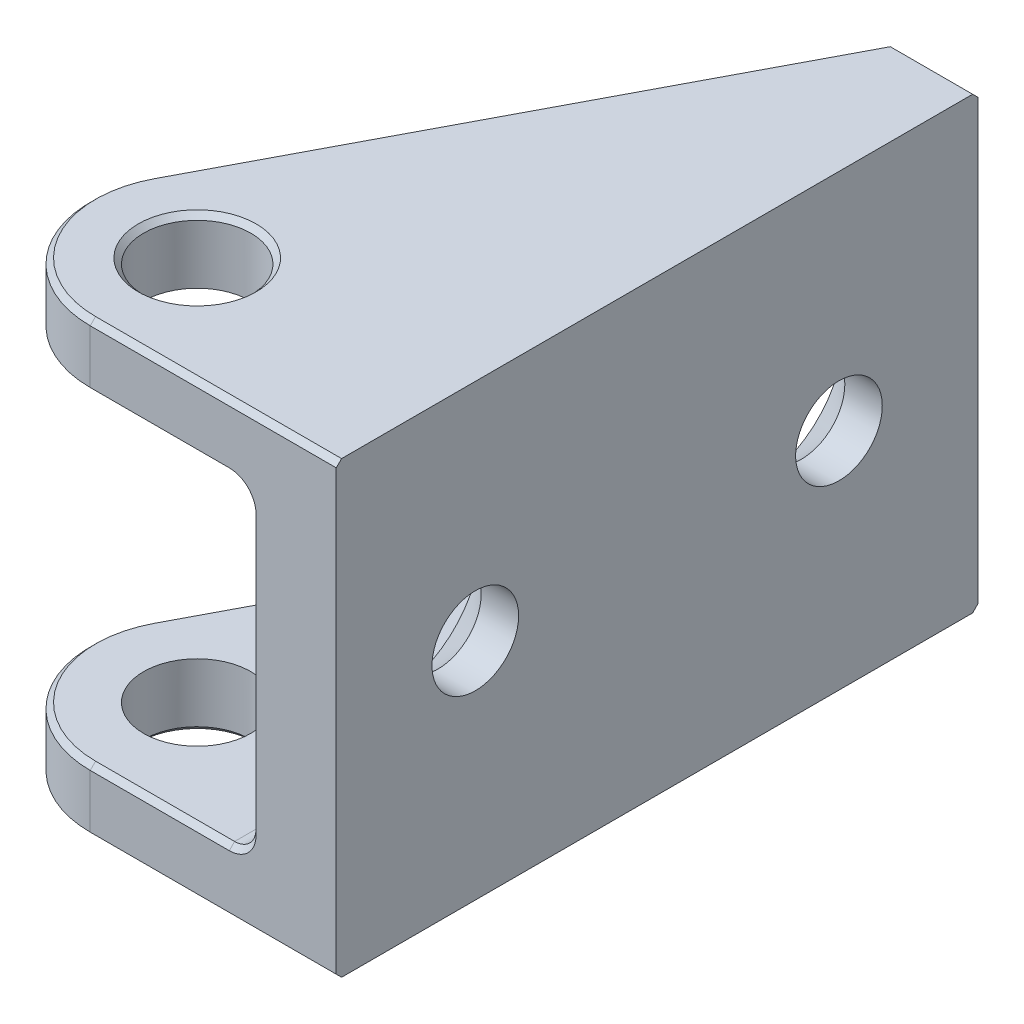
ISO-10303-21;
HEADER;
FILE_DESCRIPTION(('STEP AP214'),'2;1');
FILE_NAME('part.step','',(''),(''),'','','');
FILE_SCHEMA(('AUTOMOTIVE_DESIGN { 1 0 10303 214 1 1 1 1 }'));
ENDSEC;
DATA;
#1=APPLICATION_CONTEXT('core data for automotive mechanical design processes');
#2=APPLICATION_PROTOCOL_DEFINITION('international standard','automotive_design',2000,#1);
#3=PRODUCT_CONTEXT('',#1,'mechanical');
#4=PRODUCT('Part','Part','',(#3));
#5=PRODUCT_RELATED_PRODUCT_CATEGORY('part','',(#4));
#6=PRODUCT_DEFINITION_FORMATION('','',#4);
#7=PRODUCT_DEFINITION_CONTEXT('part definition',#1,'design');
#8=PRODUCT_DEFINITION('design','',#6,#7);
#9=PRODUCT_DEFINITION_SHAPE('','',#8);
#10=(LENGTH_UNIT() NAMED_UNIT(*) SI_UNIT(.MILLI.,.METRE.));
#11=(NAMED_UNIT(*) PLANE_ANGLE_UNIT() SI_UNIT($,.RADIAN.));
#12=(NAMED_UNIT(*) SI_UNIT($,.STERADIAN.) SOLID_ANGLE_UNIT());
#13=UNCERTAINTY_MEASURE_WITH_UNIT(LENGTH_MEASURE(1.E-05),#10,'distance_accuracy_value','');
#14=(GEOMETRIC_REPRESENTATION_CONTEXT(3) GLOBAL_UNCERTAINTY_ASSIGNED_CONTEXT((#13)) GLOBAL_UNIT_ASSIGNED_CONTEXT((#10,
#11,#12)) REPRESENTATION_CONTEXT('',''));
#15=CARTESIAN_POINT('',(0.,0.,0.));
#16=DIRECTION('',(0.,0.,1.));
#17=DIRECTION('',(1.,0.,0.));
#18=AXIS2_PLACEMENT_3D('',#15,#16,#17);
#19=CARTESIAN_POINT('',(-25.,15.,60.));
#20=DIRECTION('',(0.,1.,0.));
#21=DIRECTION('',(-1.,0.,0.));
#22=AXIS2_PLACEMENT_3D('',#19,#20,#21);
#23=PLANE('',#22);
#24=CARTESIAN_POINT('',(-15.,15.,50.));
#25=DIRECTION('',(0.,1.,0.));
#26=DIRECTION('',(-1.,0.,0.));
#27=AXIS2_PLACEMENT_3D('',#24,#25,#26);
#28=CIRCLE('',#27,5.01000000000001);
#29=CARTESIAN_POINT('',(-20.01,15.,50.));
#30=VERTEX_POINT('',#29);
#31=EDGE_CURVE('E913',#30,#30,#28,.T.);
#32=ORIENTED_EDGE('',*,*,#31,.T.);
#33=EDGE_LOOP('',(#32));
#34=FACE_BOUND('',#33,.T.);
#35=CARTESIAN_POINT('',(-15.,15.,50.));
#36=DIRECTION('',(0.,1.,0.));
#37=DIRECTION('',(-1.,0.,0.));
#38=AXIS2_PLACEMENT_3D('',#35,#36,#37);
#39=CIRCLE('',#38,9.50000000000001);
#40=CARTESIAN_POINT('',(-15.,15.,59.5));
#41=VERTEX_POINT('',#40);
#42=CARTESIAN_POINT('',(-23.4078928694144,15.,45.5776321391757));
#43=VERTEX_POINT('',#42);
#44=EDGE_CURVE('E625',#41,#43,#39,.F.);
#45=ORIENTED_EDGE('',*,*,#44,.T.);
#46=DIRECTION('',(0.465512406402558,0.,-0.885041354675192));
#47=VECTOR('',#46,1.);
#48=CARTESIAN_POINT('',(-1.55747932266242,15.,4.0351955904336));
#49=LINE('',#48,#47);
#50=CARTESIAN_POINT('',(-2.,15.,4.87652461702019));
#51=VERTEX_POINT('',#50);
#52=EDGE_CURVE('E623',#43,#51,#49,.T.);
#53=ORIENTED_EDGE('',*,*,#52,.T.);
#54=DIRECTION('',(0.,0.,-1.));
#55=VECTOR('',#54,1.);
#56=CARTESIAN_POINT('',(-2.,15.,60.));
#57=LINE('',#56,#55);
#58=CARTESIAN_POINT('',(-2.,15.,59.5));
#59=VERTEX_POINT('',#58);
#60=EDGE_CURVE('E254',#51,#59,#57,.F.);
#61=ORIENTED_EDGE('',*,*,#60,.T.);
#62=DIRECTION('',(-1.,0.,0.));
#63=VECTOR('',#62,1.);
#64=CARTESIAN_POINT('',(-15.,15.,59.5));
#65=LINE('',#64,#63);
#66=EDGE_CURVE('E621',#59,#41,#65,.T.);
#67=ORIENTED_EDGE('',*,*,#66,.T.);
#68=EDGE_LOOP('',(#45,#53,#61,#67));
#69=FACE_BOUND('',#68,.T.);
#70=ADVANCED_FACE('F54',(#34,#69),#23,.F.);
#71=CARTESIAN_POINT('',(0.,-15.,60.));
#72=DIRECTION('',(0.,-1.,0.));
#73=DIRECTION('',(1.,0.,0.));
#74=AXIS2_PLACEMENT_3D('',#71,#72,#73);
#75=PLANE('',#74);
#76=CARTESIAN_POINT('',(-15.,-15.,50.));
#77=DIRECTION('',(0.,-1.,0.));
#78=DIRECTION('',(1.,0.,0.));
#79=AXIS2_PLACEMENT_3D('',#76,#77,#78);
#80=CIRCLE('',#79,5.01000000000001);
#81=CARTESIAN_POINT('',(-9.99000000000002,-15.,50.));
#82=VERTEX_POINT('',#81);
#83=EDGE_CURVE('E918',#82,#82,#80,.T.);
#84=ORIENTED_EDGE('',*,*,#83,.T.);
#85=EDGE_LOOP('',(#84));
#86=FACE_BOUND('',#85,.T.);
#87=CARTESIAN_POINT('',(-15.,-15.,50.));
#88=DIRECTION('',(0.,-1.,0.));
#89=DIRECTION('',(1.,0.,0.));
#90=AXIS2_PLACEMENT_3D('',#87,#88,#89);
#91=CIRCLE('',#90,9.50000000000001);
#92=CARTESIAN_POINT('',(-23.4078928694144,-15.,45.5776321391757));
#93=VERTEX_POINT('',#92);
#94=CARTESIAN_POINT('',(-15.,-15.,59.5));
#95=VERTEX_POINT('',#94);
#96=EDGE_CURVE('E73',#93,#95,#91,.F.);
#97=ORIENTED_EDGE('',*,*,#96,.T.);
#98=DIRECTION('',(1.,0.,0.));
#99=VECTOR('',#98,1.);
#100=CARTESIAN_POINT('',(-2.,-15.,59.5));
#101=LINE('',#100,#99);
#102=CARTESIAN_POINT('',(-2.,-15.,59.5));
#103=VERTEX_POINT('',#102);
#104=EDGE_CURVE('E638',#95,#103,#101,.T.);
#105=ORIENTED_EDGE('',*,*,#104,.T.);
#106=DIRECTION('',(0.,0.,-1.));
#107=VECTOR('',#106,1.);
#108=CARTESIAN_POINT('',(-2.,-15.,0.));
#109=LINE('',#108,#107);
#110=CARTESIAN_POINT('',(-2.,-15.,4.87652461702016));
#111=VERTEX_POINT('',#110);
#112=EDGE_CURVE('E585',#103,#111,#109,.T.);
#113=ORIENTED_EDGE('',*,*,#112,.T.);
#114=DIRECTION('',(-0.465512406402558,0.,0.885041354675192));
#115=VECTOR('',#114,1.);
#116=CARTESIAN_POINT('',(-23.4078928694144,-15.,45.5776321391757));
#117=LINE('',#116,#115);
#118=EDGE_CURVE('E78',#111,#93,#117,.T.);
#119=ORIENTED_EDGE('',*,*,#118,.T.);
#120=EDGE_LOOP('',(#97,#105,#113,#119));
#121=FACE_BOUND('',#120,.T.);
#122=ADVANCED_FACE('F748',(#86,#121),#75,.F.);
#123=CARTESIAN_POINT('',(-25.,-21.,60.));
#124=DIRECTION('',(0.,1.,0.));
#125=DIRECTION('',(0.,0.,1.));
#126=AXIS2_PLACEMENT_3D('',#123,#124,#125);
#127=PLANE('',#126);
#128=CARTESIAN_POINT('',(-15.,-21.,50.));
#129=DIRECTION('',(0.,1.,0.));
#130=DIRECTION('',(0.,0.,1.));
#131=AXIS2_PLACEMENT_3D('',#128,#129,#130);
#132=CIRCLE('',#131,5.51000000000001);
#133=CARTESIAN_POINT('',(-15.,-21.,55.51));
#134=VERTEX_POINT('',#133);
#135=EDGE_CURVE('E235',#134,#134,#132,.T.);
#136=ORIENTED_EDGE('',*,*,#135,.T.);
#137=EDGE_LOOP('',(#136));
#138=FACE_BOUND('',#137,.T.);
#139=DIRECTION('',(0.465512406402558,0.,-0.885041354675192));
#140=VECTOR('',#139,1.);
#141=CARTESIAN_POINT('',(0.442520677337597,-21.,0.232756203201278));
#142=LINE('',#141,#140);
#143=CARTESIAN_POINT('',(-23.4078928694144,-21.,45.5776321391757));
#144=VERTEX_POINT('',#143);
#145=CARTESIAN_POINT('',(0.301956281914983,-21.,0.5));
#146=VERTEX_POINT('',#145);
#147=EDGE_CURVE('E258',#144,#146,#142,.T.);
#148=ORIENTED_EDGE('',*,*,#147,.T.);
#149=DIRECTION('',(1.,0.,0.));
#150=VECTOR('',#149,1.);
#151=CARTESIAN_POINT('',(-25.,-21.,0.5));
#152=LINE('',#151,#150);
#153=CARTESIAN_POINT('',(8.,-21.,0.5));
#154=VERTEX_POINT('',#153);
#155=EDGE_CURVE('E243',#146,#154,#152,.T.);
#156=ORIENTED_EDGE('',*,*,#155,.T.);
#157=DIRECTION('',(0.,0.,-1.));
#158=VECTOR('',#157,1.);
#159=CARTESIAN_POINT('',(8.,-21.,60.));
#160=LINE('',#159,#158);
#161=CARTESIAN_POINT('',(8.,-21.,59.5));
#162=VERTEX_POINT('',#161);
#163=EDGE_CURVE('E227',#162,#154,#160,.T.);
#164=ORIENTED_EDGE('',*,*,#163,.F.);
#165=DIRECTION('',(-1.,0.,0.));
#166=VECTOR('',#165,1.);
#167=CARTESIAN_POINT('',(-15.,-21.,59.5));
#168=LINE('',#167,#166);
#169=CARTESIAN_POINT('',(-15.,-21.,59.5));
#170=VERTEX_POINT('',#169);
#171=EDGE_CURVE('E240',#162,#170,#168,.T.);
#172=ORIENTED_EDGE('',*,*,#171,.T.);
#173=CARTESIAN_POINT('',(-15.,-21.,50.));
#174=DIRECTION('',(0.,1.,0.));
#175=DIRECTION('',(0.,0.,1.));
#176=AXIS2_PLACEMENT_3D('',#173,#174,#175);
#177=CIRCLE('',#176,9.49999999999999);
#178=EDGE_CURVE('E253',#170,#144,#177,.F.);
#179=ORIENTED_EDGE('',*,*,#178,.T.);
#180=EDGE_LOOP('',(#148,#156,#164,#172,#179));
#181=FACE_BOUND('',#180,.T.);
#182=ADVANCED_FACE('F239',(#138,#181),#127,.F.);
#183=CARTESIAN_POINT('',(8.,21.,60.));
#184=DIRECTION('',(0.,-1.,0.));
#185=DIRECTION('',(0.,0.,-1.));
#186=AXIS2_PLACEMENT_3D('',#183,#184,#185);
#187=PLANE('',#186);
#188=CARTESIAN_POINT('',(-15.,21.,50.));
#189=DIRECTION('',(0.,-1.,0.));
#190=DIRECTION('',(0.,0.,-1.));
#191=AXIS2_PLACEMENT_3D('',#188,#189,#190);
#192=CIRCLE('',#191,5.51000000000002);
#193=CARTESIAN_POINT('',(-15.,21.,44.49));
#194=VERTEX_POINT('',#193);
#195=EDGE_CURVE('E845',#194,#194,#192,.T.);
#196=ORIENTED_EDGE('',*,*,#195,.T.);
#197=EDGE_LOOP('',(#196));
#198=FACE_BOUND('',#197,.T.);
#199=CARTESIAN_POINT('',(-15.,21.,50.));
#200=DIRECTION('',(0.,-1.,0.));
#201=DIRECTION('',(0.,0.,-1.));
#202=AXIS2_PLACEMENT_3D('',#199,#200,#201);
#203=CIRCLE('',#202,9.49999999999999);
#204=CARTESIAN_POINT('',(-23.4078928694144,21.,45.5776321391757));
#205=VERTEX_POINT('',#204);
#206=CARTESIAN_POINT('',(-15.,21.,59.5));
#207=VERTEX_POINT('',#206);
#208=EDGE_CURVE('E840',#205,#207,#203,.F.);
#209=ORIENTED_EDGE('',*,*,#208,.T.);
#210=DIRECTION('',(1.,0.,0.));
#211=VECTOR('',#210,1.);
#212=CARTESIAN_POINT('',(8.,21.,59.5));
#213=LINE('',#212,#211);
#214=CARTESIAN_POINT('',(8.,21.,59.5));
#215=VERTEX_POINT('',#214);
#216=EDGE_CURVE('E677',#207,#215,#213,.T.);
#217=ORIENTED_EDGE('',*,*,#216,.T.);
#218=DIRECTION('',(0.,0.,-1.));
#219=VECTOR('',#218,1.);
#220=CARTESIAN_POINT('',(8.,21.,60.));
#221=LINE('',#220,#219);
#222=CARTESIAN_POINT('',(8.,21.,0.499999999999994));
#223=VERTEX_POINT('',#222);
#224=EDGE_CURVE('E246',#215,#223,#221,.T.);
#225=ORIENTED_EDGE('',*,*,#224,.T.);
#226=DIRECTION('',(-1.,0.,0.));
#227=VECTOR('',#226,1.);
#228=CARTESIAN_POINT('',(8.,21.,0.499999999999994));
#229=LINE('',#228,#227);
#230=CARTESIAN_POINT('',(0.301956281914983,21.,0.499999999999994));
#231=VERTEX_POINT('',#230);
#232=EDGE_CURVE('E837',#223,#231,#229,.T.);
#233=ORIENTED_EDGE('',*,*,#232,.T.);
#234=DIRECTION('',(-0.465512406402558,0.,0.885041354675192));
#235=VECTOR('',#234,1.);
#236=CARTESIAN_POINT('',(-23.4078928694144,21.,45.5776321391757));
#237=LINE('',#236,#235);
#238=EDGE_CURVE('E834',#231,#205,#237,.T.);
#239=ORIENTED_EDGE('',*,*,#238,.T.);
#240=EDGE_LOOP('',(#209,#217,#225,#233,#239));
#241=FACE_BOUND('',#240,.T.);
#242=ADVANCED_FACE('F742',(#198,#241),#187,.F.);
#243=CARTESIAN_POINT('',(0.,0.,0.));
#244=DIRECTION('',(0.,0.,1.));
#245=DIRECTION('',(1.,0.,0.));
#246=AXIS2_PLACEMENT_3D('',#243,#244,#245);
#247=PLANE('',#246);
#248=DIRECTION('',(0.,1.,0.));
#249=VECTOR('',#248,1.);
#250=CARTESIAN_POINT('',(8.,-21.,0.));
#251=LINE('',#250,#249);
#252=CARTESIAN_POINT('',(8.,-20.5,0.));
#253=VERTEX_POINT('',#252);
#254=CARTESIAN_POINT('',(8.,20.5,0.));
#255=VERTEX_POINT('',#254);
#256=EDGE_CURVE('E906',#253,#255,#251,.T.);
#257=ORIENTED_EDGE('',*,*,#256,.F.);
#258=DIRECTION('',(-1.,0.,0.));
#259=VECTOR('',#258,1.);
#260=CARTESIAN_POINT('',(0.,-20.5,0.));
#261=LINE('',#260,#259);
#262=CARTESIAN_POINT('',(0.,-20.5,0.));
#263=VERTEX_POINT('',#262);
#264=EDGE_CURVE('E295',#253,#263,#261,.T.);
#265=ORIENTED_EDGE('',*,*,#264,.T.);
#266=DIRECTION('',(0.,-1.,0.));
#267=VECTOR('',#266,1.);
#268=CARTESIAN_POINT('',(0.,0.,0.));
#269=LINE('',#268,#267);
#270=CARTESIAN_POINT('',(0.,-14.5,0.));
#271=VERTEX_POINT('',#270);
#272=EDGE_CURVE('E245',#271,#263,#269,.T.);
#273=ORIENTED_EDGE('',*,*,#272,.F.);
#274=CARTESIAN_POINT('',(-2.,-13.,0.));
#275=DIRECTION('',(0.,0.,1.));
#276=DIRECTION('',(1.,0.,0.));
#277=AXIS2_PLACEMENT_3D('',#274,#275,#276);
#278=CIRCLE('',#277,2.5);
#279=CARTESIAN_POINT('',(0.500000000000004,-13.,0.));
#280=VERTEX_POINT('',#279);
#281=EDGE_CURVE('E292',#271,#280,#278,.T.);
#282=ORIENTED_EDGE('',*,*,#281,.T.);
#283=DIRECTION('',(0.,1.,0.));
#284=VECTOR('',#283,1.);
#285=CARTESIAN_POINT('',(0.5,0.,0.));
#286=LINE('',#285,#284);
#287=CARTESIAN_POINT('',(0.499999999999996,13.,0.));
#288=VERTEX_POINT('',#287);
#289=EDGE_CURVE('E289',#280,#288,#286,.T.);
#290=ORIENTED_EDGE('',*,*,#289,.T.);
#291=CARTESIAN_POINT('',(-2.,13.,0.));
#292=DIRECTION('',(0.,0.,1.));
#293=DIRECTION('',(1.,0.,0.));
#294=AXIS2_PLACEMENT_3D('',#291,#292,#293);
#295=CIRCLE('',#294,2.5);
#296=CARTESIAN_POINT('',(0.,14.5,0.));
#297=VERTEX_POINT('',#296);
#298=EDGE_CURVE('E285',#288,#297,#295,.T.);
#299=ORIENTED_EDGE('',*,*,#298,.T.);
#300=CARTESIAN_POINT('',(0.,20.5,0.));
#301=VERTEX_POINT('',#300);
#302=EDGE_CURVE('E699',#301,#297,#269,.T.);
#303=ORIENTED_EDGE('',*,*,#302,.F.);
#304=DIRECTION('',(1.,0.,0.));
#305=VECTOR('',#304,1.);
#306=CARTESIAN_POINT('',(0.,20.5,0.));
#307=LINE('',#306,#305);
#308=EDGE_CURVE('E282',#301,#255,#307,.T.);
#309=ORIENTED_EDGE('',*,*,#308,.T.);
#310=EDGE_LOOP('',(#257,#265,#273,#282,#290,#299,#303,#309));
#311=FACE_BOUND('',#310,.T.);
#312=ADVANCED_FACE('F733',(#311),#247,.F.);
#313=CARTESIAN_POINT('',(0.,15.,60.));
#314=DIRECTION('',(1.,0.,0.));
#315=DIRECTION('',(0.,1.,0.));
#316=AXIS2_PLACEMENT_3D('',#313,#314,#315);
#317=PLANE('',#316);
#318=CARTESIAN_POINT('',(0.,0.,47.));
#319=DIRECTION('',(1.,0.,0.));
#320=DIRECTION('',(0.,1.,0.));
#321=AXIS2_PLACEMENT_3D('',#318,#319,#320);
#322=CIRCLE('',#321,8.54999999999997);
#323=CARTESIAN_POINT('',(0.,8.54999999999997,47.));
#324=VERTEX_POINT('',#323);
#325=EDGE_CURVE('E711',#324,#324,#322,.T.);
#326=ORIENTED_EDGE('',*,*,#325,.T.);
#327=EDGE_LOOP('',(#326));
#328=FACE_BOUND('',#327,.T.);
#329=CARTESIAN_POINT('',(0.,0.,13.));
#330=DIRECTION('',(1.,0.,0.));
#331=DIRECTION('',(0.,1.,0.));
#332=AXIS2_PLACEMENT_3D('',#329,#330,#331);
#333=CIRCLE('',#332,8.55000000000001);
#334=CARTESIAN_POINT('',(0.,8.55000000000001,13.));
#335=VERTEX_POINT('',#334);
#336=EDGE_CURVE('E704',#335,#335,#333,.T.);
#337=ORIENTED_EDGE('',*,*,#336,.T.);
#338=EDGE_LOOP('',(#337));
#339=FACE_BOUND('',#338,.T.);
#340=DIRECTION('',(0.,0.,-1.));
#341=VECTOR('',#340,1.);
#342=CARTESIAN_POINT('',(0.,13.,0.));
#343=LINE('',#342,#341);
#344=CARTESIAN_POINT('',(0.,13.,59.5));
#345=VERTEX_POINT('',#344);
#346=CARTESIAN_POINT('',(0.,13.,0.5));
#347=VERTEX_POINT('',#346);
#348=EDGE_CURVE('E589',#345,#347,#343,.T.);
#349=ORIENTED_EDGE('',*,*,#348,.T.);
#350=DIRECTION('',(0.,-1.,0.));
#351=VECTOR('',#350,1.);
#352=CARTESIAN_POINT('',(0.,15.,0.5));
#353=LINE('',#352,#351);
#354=CARTESIAN_POINT('',(0.,-13.,0.5));
#355=VERTEX_POINT('',#354);
#356=EDGE_CURVE('E576',#347,#355,#353,.T.);
#357=ORIENTED_EDGE('',*,*,#356,.T.);
#358=DIRECTION('',(0.,0.,-1.));
#359=VECTOR('',#358,1.);
#360=CARTESIAN_POINT('',(0.,-13.,60.));
#361=LINE('',#360,#359);
#362=CARTESIAN_POINT('',(0.,-13.,59.5));
#363=VERTEX_POINT('',#362);
#364=EDGE_CURVE('E261',#355,#363,#361,.F.);
#365=ORIENTED_EDGE('',*,*,#364,.T.);
#366=DIRECTION('',(0.,1.,0.));
#367=VECTOR('',#366,1.);
#368=CARTESIAN_POINT('',(0.,13.,59.5));
#369=LINE('',#368,#367);
#370=EDGE_CURVE('E573',#363,#345,#369,.T.);
#371=ORIENTED_EDGE('',*,*,#370,.T.);
#372=EDGE_LOOP('',(#349,#357,#365,#371));
#373=FACE_BOUND('',#372,.T.);
#374=ADVANCED_FACE('F600',(#328,#339,#373),#317,.F.);
#375=CARTESIAN_POINT('',(8.,-21.,60.));
#376=DIRECTION('',(-1.,0.,0.));
#377=DIRECTION('',(0.,0.,1.));
#378=AXIS2_PLACEMENT_3D('',#375,#376,#377);
#379=PLANE('',#378);
#380=CARTESIAN_POINT('',(8.,0.,13.));
#381=DIRECTION('',(1.,0.,0.));
#382=DIRECTION('',(0.,0.,-1.));
#383=AXIS2_PLACEMENT_3D('',#380,#381,#382);
#384=CIRCLE('',#383,4.05);
#385=CARTESIAN_POINT('',(8.,0.,8.95));
#386=VERTEX_POINT('',#385);
#387=EDGE_CURVE('E971',#386,#386,#384,.T.);
#388=ORIENTED_EDGE('',*,*,#387,.F.);
#389=EDGE_LOOP('',(#388));
#390=FACE_BOUND('',#389,.T.);
#391=CARTESIAN_POINT('',(8.,0.,47.));
#392=DIRECTION('',(1.,0.,0.));
#393=DIRECTION('',(0.,0.,-1.));
#394=AXIS2_PLACEMENT_3D('',#391,#392,#393);
#395=CIRCLE('',#394,4.05);
#396=CARTESIAN_POINT('',(8.,0.,42.95));
#397=VERTEX_POINT('',#396);
#398=EDGE_CURVE('E653',#397,#397,#395,.T.);
#399=ORIENTED_EDGE('',*,*,#398,.F.);
#400=EDGE_LOOP('',(#399));
#401=FACE_BOUND('',#400,.T.);
#402=ORIENTED_EDGE('',*,*,#163,.T.);
#403=DIRECTION('',(0.,-0.707106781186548,0.707106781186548));
#404=VECTOR('',#403,1.);
#405=CARTESIAN_POINT('',(8.,-21.,0.5));
#406=LINE('',#405,#404);
#407=EDGE_CURVE('E279',#154,#253,#406,.F.);
#408=ORIENTED_EDGE('',*,*,#407,.T.);
#409=ORIENTED_EDGE('',*,*,#256,.T.);
#410=DIRECTION('',(0.,-0.707106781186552,-0.707106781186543));
#411=VECTOR('',#410,1.);
#412=CARTESIAN_POINT('',(8.,21.,0.499999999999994));
#413=LINE('',#412,#411);
#414=EDGE_CURVE('E234',#255,#223,#413,.F.);
#415=ORIENTED_EDGE('',*,*,#414,.T.);
#416=ORIENTED_EDGE('',*,*,#224,.F.);
#417=DIRECTION('',(0.,-0.707106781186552,0.707106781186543));
#418=VECTOR('',#417,1.);
#419=CARTESIAN_POINT('',(8.,20.5,60.));
#420=LINE('',#419,#418);
#421=CARTESIAN_POINT('',(8.,20.5,60.));
#422=VERTEX_POINT('',#421);
#423=EDGE_CURVE('E276',#215,#422,#420,.T.);
#424=ORIENTED_EDGE('',*,*,#423,.T.);
#425=DIRECTION('',(0.,1.,0.));
#426=VECTOR('',#425,1.);
#427=CARTESIAN_POINT('',(8.,-21.,60.));
#428=LINE('',#427,#426);
#429=CARTESIAN_POINT('',(8.,-20.5,60.));
#430=VERTEX_POINT('',#429);
#431=EDGE_CURVE('E229',#430,#422,#428,.T.);
#432=ORIENTED_EDGE('',*,*,#431,.F.);
#433=DIRECTION('',(0.,-0.707106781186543,-0.707106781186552));
#434=VECTOR('',#433,1.);
#435=CARTESIAN_POINT('',(8.,-20.5,60.));
#436=LINE('',#435,#434);
#437=EDGE_CURVE('E224',#430,#162,#436,.T.);
#438=ORIENTED_EDGE('',*,*,#437,.T.);
#439=EDGE_LOOP('',(#402,#408,#409,#415,#416,#424,#432,#438));
#440=FACE_BOUND('',#439,.T.);
#441=ADVANCED_FACE('F226',(#390,#401,#440),#379,.F.);
#442=CARTESIAN_POINT('',(0.,0.,60.));
#443=DIRECTION('',(0.,0.,1.));
#444=DIRECTION('',(1.,0.,0.));
#445=AXIS2_PLACEMENT_3D('',#442,#443,#444);
#446=PLANE('',#445);
#447=ORIENTED_EDGE('',*,*,#431,.T.);
#448=DIRECTION('',(-1.,0.,0.));
#449=VECTOR('',#448,1.);
#450=CARTESIAN_POINT('',(-15.,20.5,60.));
#451=LINE('',#450,#449);
#452=CARTESIAN_POINT('',(-15.,20.5,60.));
#453=VERTEX_POINT('',#452);
#454=EDGE_CURVE('E676',#422,#453,#451,.T.);
#455=ORIENTED_EDGE('',*,*,#454,.T.);
#456=DIRECTION('',(0.,1.,0.));
#457=VECTOR('',#456,1.);
#458=CARTESIAN_POINT('',(-15.,-59.,60.));
#459=LINE('',#458,#457);
#460=CARTESIAN_POINT('',(-15.,15.5,60.));
#461=VERTEX_POINT('',#460);
#462=EDGE_CURVE('E690',#461,#453,#459,.T.);
#463=ORIENTED_EDGE('',*,*,#462,.F.);
#464=DIRECTION('',(1.,0.,0.));
#465=VECTOR('',#464,1.);
#466=CARTESIAN_POINT('',(-2.00000000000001,15.5,60.));
#467=LINE('',#466,#465);
#468=CARTESIAN_POINT('',(-2.,15.5,60.));
#469=VERTEX_POINT('',#468);
#470=EDGE_CURVE('E693',#461,#469,#467,.T.);
#471=ORIENTED_EDGE('',*,*,#470,.T.);
#472=CARTESIAN_POINT('',(-2.,13.,60.));
#473=DIRECTION('',(0.,0.,1.));
#474=DIRECTION('',(1.,0.,0.));
#475=AXIS2_PLACEMENT_3D('',#472,#473,#474);
#476=CIRCLE('',#475,2.49999999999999);
#477=CARTESIAN_POINT('',(0.499999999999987,13.,60.));
#478=VERTEX_POINT('',#477);
#479=EDGE_CURVE('E863',#469,#478,#476,.F.);
#480=ORIENTED_EDGE('',*,*,#479,.T.);
#481=DIRECTION('',(0.,-1.,0.));
#482=VECTOR('',#481,1.);
#483=CARTESIAN_POINT('',(0.499999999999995,-13.,60.));
#484=LINE('',#483,#482);
#485=CARTESIAN_POINT('',(0.499999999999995,-13.,60.));
#486=VERTEX_POINT('',#485);
#487=EDGE_CURVE('E614',#478,#486,#484,.T.);
#488=ORIENTED_EDGE('',*,*,#487,.T.);
#489=CARTESIAN_POINT('',(-2.,-13.,60.));
#490=DIRECTION('',(0.,0.,1.));
#491=DIRECTION('',(1.,0.,0.));
#492=AXIS2_PLACEMENT_3D('',#489,#490,#491);
#493=CIRCLE('',#492,2.49999999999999);
#494=CARTESIAN_POINT('',(-2.,-15.5,60.));
#495=VERTEX_POINT('',#494);
#496=EDGE_CURVE('E608',#486,#495,#493,.F.);
#497=ORIENTED_EDGE('',*,*,#496,.T.);
#498=DIRECTION('',(-1.,0.,0.));
#499=VECTOR('',#498,1.);
#500=CARTESIAN_POINT('',(-15.,-15.5,60.));
#501=LINE('',#500,#499);
#502=CARTESIAN_POINT('',(-15.,-15.5,60.));
#503=VERTEX_POINT('',#502);
#504=EDGE_CURVE('E856',#495,#503,#501,.T.);
#505=ORIENTED_EDGE('',*,*,#504,.T.);
#506=CARTESIAN_POINT('',(-15.,-20.5,60.));
#507=VERTEX_POINT('',#506);
#508=EDGE_CURVE('E698',#507,#503,#459,.T.);
#509=ORIENTED_EDGE('',*,*,#508,.F.);
#510=DIRECTION('',(1.,0.,0.));
#511=VECTOR('',#510,1.);
#512=CARTESIAN_POINT('',(8.,-20.5,60.));
#513=LINE('',#512,#511);
#514=EDGE_CURVE('E853',#507,#430,#513,.T.);
#515=ORIENTED_EDGE('',*,*,#514,.T.);
#516=EDGE_LOOP('',(#447,#455,#463,#471,#480,#488,#497,#505,#509,#515));
#517=FACE_BOUND('',#516,.T.);
#518=ADVANCED_FACE('F689',(#517),#446,.T.);
#519=CARTESIAN_POINT('',(0.,-59.,0.));
#520=DIRECTION('',(-0.885041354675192,0.,-0.465512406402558));
#521=DIRECTION('',(-0.465512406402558,0.,0.885041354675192));
#522=AXIS2_PLACEMENT_3D('',#519,#520,#521);
#523=PLANE('',#522);
#524=CARTESIAN_POINT('',(0.0497726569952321,-12.8038522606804,-0.0946287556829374));
#525=CARTESIAN_POINT('',(0.0632658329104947,-12.9751286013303,-0.120282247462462));
#526=CARTESIAN_POINT('',(0.0590138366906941,-13.1477928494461,-0.112198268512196));
#527=CARTESIAN_POINT('',(0.0152782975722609,-13.4886121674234,-0.0290474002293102));
#528=CARTESIAN_POINT('',(-0.0242163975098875,-13.656751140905,0.0460406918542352));
#529=CARTESIAN_POINT('',(-0.136794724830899,-13.9813997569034,0.26007682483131));
#530=CARTESIAN_POINT('',(-0.209872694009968,-14.1378930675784,0.399014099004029));
#531=CARTESIAN_POINT('',(-0.386525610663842,-14.4326206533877,0.734870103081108));
#532=CARTESIAN_POINT('',(-0.49009167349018,-14.5708401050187,0.93177194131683));
#533=CARTESIAN_POINT('',(-0.723337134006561,-14.823163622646,1.37522280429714));
#534=CARTESIAN_POINT('',(-0.853004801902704,-14.9372549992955,1.62174952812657));
#535=CARTESIAN_POINT('',(-1.13296381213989,-15.1364874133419,2.1540131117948));
#536=CARTESIAN_POINT('',(-1.2832410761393,-15.2216184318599,2.43972320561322));
#537=CARTESIAN_POINT('',(-1.59805611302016,-15.3593213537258,3.03825575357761));
#538=CARTESIAN_POINT('',(-1.76257805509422,-15.4118863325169,3.3510481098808));
#539=CARTESIAN_POINT('',(-2.09891528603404,-15.4822274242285,3.99049907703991));
#540=CARTESIAN_POINT('',(-2.27071366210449,-15.5000133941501,4.31712553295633));
#541=CARTESIAN_POINT('',(-2.44252067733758,-15.5,4.64376841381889));
#542=B_SPLINE_CURVE_WITH_KNOTS('',3,(#524,#525,#526,#527,#528,#529,#530,#531,#532,#533,#534,
#535,#536,#537,#538,#539,#540,#541),.UNSPECIFIED.,.F.,.F.,(4,2,2,2,2,2,2,2,4),(3.06305283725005,
3.26921985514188,3.47538687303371,3.68155389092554,3.88772090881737,4.0938879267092,
4.30005494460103,4.50622196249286,4.71238898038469),.UNSPECIFIED.);
#543=CARTESIAN_POINT('',(-2.44252067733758,-15.5,4.64376841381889));
#544=VERTEX_POINT('',#543);
#545=CARTESIAN_POINT('',(-0.203618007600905,-14.112323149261,0.387122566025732));
#546=VERTEX_POINT('',#545);
#547=EDGE_CURVE('E509',#544,#546,#542,.F.);
#548=ORIENTED_EDGE('',*,*,#547,.T.);
#549=CARTESIAN_POINT('',(-0.2036180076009,-14.112323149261,0.387122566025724));
#550=CARTESIAN_POINT('',(-0.18700484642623,-14.1454814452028,0.355537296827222));
#551=CARTESIAN_POINT('',(-0.170277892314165,-14.1783742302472,0.323735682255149));
#552=CARTESIAN_POINT('',(-0.136636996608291,-14.2437081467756,0.259776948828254));
#553=CARTESIAN_POINT('',(-0.119723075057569,-14.2761493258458,0.227619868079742));
#554=CARTESIAN_POINT('',(-0.085745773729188,-14.340665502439,0.163021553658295));
#555=CARTESIAN_POINT('',(-0.0686823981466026,-14.3727405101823,0.130580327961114));
#556=CARTESIAN_POINT('',(-0.034429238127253,-14.4365855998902,0.0654575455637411));
#557=CARTESIAN_POINT('',(-0.017239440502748,-14.4683556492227,0.0327759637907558));
#558=CARTESIAN_POINT('',(0.,-14.5,0.));
#559=B_SPLINE_CURVE_WITH_KNOTS('',3,(#549,#550,#551,#552,#553,#554,#555,#556,#557,#558),
.UNSPECIFIED.,.F.,.F.,(4,2,2,2,4),(0.,0.146139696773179,0.292263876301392,0.438383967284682,
0.58451952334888),.UNSPECIFIED.);
#560=EDGE_CURVE('E816',#546,#271,#559,.T.);
#561=ORIENTED_EDGE('',*,*,#560,.T.);
#562=ORIENTED_EDGE('',*,*,#272,.T.);
#563=DIRECTION('',(-0.465512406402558,0.,0.885041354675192));
#564=VECTOR('',#563,1.);
#565=CARTESIAN_POINT('',(-23.850413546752,-20.5,45.3448759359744));
#566=LINE('',#565,#564);
#567=CARTESIAN_POINT('',(-23.850413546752,-20.5,45.3448759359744));
#568=VERTEX_POINT('',#567);
#569=EDGE_CURVE('E876',#263,#568,#566,.T.);
#570=ORIENTED_EDGE('',*,*,#569,.T.);
#571=DIRECTION('',(0.,1.,0.));
#572=VECTOR('',#571,1.);
#573=CARTESIAN_POINT('',(-23.850413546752,-59.,45.3448759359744));
#574=LINE('',#573,#572);
#575=CARTESIAN_POINT('',(-23.8504135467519,-15.5,45.3448759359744));
#576=VERTEX_POINT('',#575);
#577=EDGE_CURVE('E898',#568,#576,#574,.T.);
#578=ORIENTED_EDGE('',*,*,#577,.T.);
#579=DIRECTION('',(0.465512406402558,0.,-0.885041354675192));
#580=VECTOR('',#579,1.);
#581=CARTESIAN_POINT('',(-1.99999999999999,-15.5,3.80243938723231));
#582=LINE('',#581,#580);
#583=EDGE_CURVE('E874',#576,#544,#582,.T.);
#584=ORIENTED_EDGE('',*,*,#583,.T.);
#585=EDGE_LOOP('',(#548,#561,#562,#570,#578,#584));
#586=FACE_BOUND('',#585,.T.);
#587=ADVANCED_FACE('F785',(#586),#523,.T.);
#588=CARTESIAN_POINT('',(-15.,-59.,50.));
#589=DIRECTION('',(0.,1.,0.));
#590=DIRECTION('',(-1.,0.,0.));
#591=AXIS2_PLACEMENT_3D('',#588,#589,#590);
#592=CYLINDRICAL_SURFACE('',#591,9.99999999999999);
#593=ORIENTED_EDGE('',*,*,#508,.T.);
#594=CARTESIAN_POINT('',(-15.,-15.5,50.));
#595=DIRECTION('',(0.,-1.,0.));
#596=DIRECTION('',(0.,0.,-1.));
#597=AXIS2_PLACEMENT_3D('',#594,#595,#596);
#598=CIRCLE('',#597,9.99999999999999);
#599=EDGE_CURVE('E12',#503,#576,#598,.T.);
#600=ORIENTED_EDGE('',*,*,#599,.T.);
#601=ORIENTED_EDGE('',*,*,#577,.F.);
#602=CARTESIAN_POINT('',(-15.,-20.5,50.));
#603=DIRECTION('',(0.,1.,0.));
#604=DIRECTION('',(0.,0.,1.));
#605=AXIS2_PLACEMENT_3D('',#602,#603,#604);
#606=CIRCLE('',#605,9.99999999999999);
#607=EDGE_CURVE('E65',#568,#507,#606,.T.);
#608=ORIENTED_EDGE('',*,*,#607,.T.);
#609=EDGE_LOOP('',(#593,#600,#601,#608));
#610=FACE_BOUND('',#609,.T.);
#611=ADVANCED_FACE('F779',(#610),#592,.T.);
#612=ORIENTED_EDGE('',*,*,#462,.T.);
#613=CARTESIAN_POINT('',(-15.,20.5,50.));
#614=DIRECTION('',(0.,-1.,0.));
#615=DIRECTION('',(0.,0.,-1.));
#616=AXIS2_PLACEMENT_3D('',#613,#614,#615);
#617=CIRCLE('',#616,9.99999999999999);
#618=CARTESIAN_POINT('',(-23.8504135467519,20.5,45.3448759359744));
#619=VERTEX_POINT('',#618);
#620=EDGE_CURVE('E678',#453,#619,#617,.T.);
#621=ORIENTED_EDGE('',*,*,#620,.T.);
#622=CARTESIAN_POINT('',(-23.8504135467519,15.5,45.3448759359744));
#623=VERTEX_POINT('',#622);
#624=EDGE_CURVE('E928',#623,#619,#574,.T.);
#625=ORIENTED_EDGE('',*,*,#624,.F.);
#626=CARTESIAN_POINT('',(-15.,15.5,50.));
#627=DIRECTION('',(0.,1.,0.));
#628=DIRECTION('',(0.,0.,1.));
#629=AXIS2_PLACEMENT_3D('',#626,#627,#628);
#630=CIRCLE('',#629,9.99999999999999);
#631=EDGE_CURVE('E685',#623,#461,#630,.T.);
#632=ORIENTED_EDGE('',*,*,#631,.T.);
#633=EDGE_LOOP('',(#612,#621,#625,#632));
#634=FACE_BOUND('',#633,.T.);
#635=ADVANCED_FACE('F695',(#634),#592,.T.);
#636=ORIENTED_EDGE('',*,*,#624,.T.);
#637=DIRECTION('',(0.465512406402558,0.,-0.885041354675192));
#638=VECTOR('',#637,1.);
#639=CARTESIAN_POINT('',(0.,20.5,0.));
#640=LINE('',#639,#638);
#641=EDGE_CURVE('E821',#619,#301,#640,.T.);
#642=ORIENTED_EDGE('',*,*,#641,.T.);
#643=ORIENTED_EDGE('',*,*,#302,.T.);
#644=CARTESIAN_POINT('',(0.,14.5,0.));
#645=CARTESIAN_POINT('',(-0.0172394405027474,14.4683556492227,0.0327759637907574));
#646=CARTESIAN_POINT('',(-0.0344292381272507,14.4365855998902,0.0654575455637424));
#647=CARTESIAN_POINT('',(-0.0686823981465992,14.3727405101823,0.130580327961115));
#648=CARTESIAN_POINT('',(-0.0857457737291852,14.340665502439,0.163021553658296));
#649=CARTESIAN_POINT('',(-0.119723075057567,14.2761493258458,0.227619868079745));
#650=CARTESIAN_POINT('',(-0.136636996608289,14.2437081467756,0.259776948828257));
#651=CARTESIAN_POINT('',(-0.170277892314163,14.1783742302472,0.323735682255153));
#652=CARTESIAN_POINT('',(-0.18700484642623,14.1454814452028,0.355537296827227));
#653=CARTESIAN_POINT('',(-0.2036180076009,14.112323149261,0.387122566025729));
#654=B_SPLINE_CURVE_WITH_KNOTS('',3,(#644,#645,#646,#647,#648,#649,#650,#651,#652,#653),
.UNSPECIFIED.,.F.,.F.,(4,2,2,2,4),(0.,0.146135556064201,0.292255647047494,0.438379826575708,
0.584519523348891),.UNSPECIFIED.);
#655=CARTESIAN_POINT('',(-0.203618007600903,14.112323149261,0.387122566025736));
#656=VERTEX_POINT('',#655);
#657=EDGE_CURVE('E819',#297,#656,#654,.T.);
#658=ORIENTED_EDGE('',*,*,#657,.T.);
#659=CARTESIAN_POINT('',(-2.44252067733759,15.5,4.64376841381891));
#660=CARTESIAN_POINT('',(-2.27071366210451,15.50001339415,4.31712553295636));
#661=CARTESIAN_POINT('',(-2.09891528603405,15.4822274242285,3.99049907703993));
#662=CARTESIAN_POINT('',(-1.76257805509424,15.4118863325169,3.35104810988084));
#663=CARTESIAN_POINT('',(-1.59805611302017,15.3593213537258,3.03825575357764));
#664=CARTESIAN_POINT('',(-1.28324107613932,15.2216184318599,2.43972320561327));
#665=CARTESIAN_POINT('',(-1.13296381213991,15.1364874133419,2.15401311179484));
#666=CARTESIAN_POINT('',(-0.853004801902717,14.9372549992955,1.6217495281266));
#667=CARTESIAN_POINT('',(-0.723337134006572,14.823163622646,1.37522280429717));
#668=CARTESIAN_POINT('',(-0.490091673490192,14.5708401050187,0.931771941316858));
#669=CARTESIAN_POINT('',(-0.386525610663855,14.4326206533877,0.734870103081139));
#670=CARTESIAN_POINT('',(-0.209872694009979,14.1378930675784,0.399014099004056));
#671=CARTESIAN_POINT('',(-0.136794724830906,13.9813997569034,0.260076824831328));
#672=CARTESIAN_POINT('',(-0.0242163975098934,13.656751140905,0.0460406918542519));
#673=CARTESIAN_POINT('',(0.0152782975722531,13.4886121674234,-0.0290474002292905));
#674=CARTESIAN_POINT('',(0.0590138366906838,13.1477928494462,-0.112198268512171));
#675=CARTESIAN_POINT('',(0.0632658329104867,12.9751286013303,-0.120282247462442));
#676=CARTESIAN_POINT('',(0.0497726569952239,12.8038522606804,-0.0946287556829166));
#677=B_SPLINE_CURVE_WITH_KNOTS('',3,(#659,#660,#661,#662,#663,#664,#665,#666,#667,#668,#669,
#670,#671,#672,#673,#674,#675,#676),.UNSPECIFIED.,.F.,.F.,(4,2,2,2,2,2,2,2,4),(1.5707963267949,
1.77696334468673,1.98313036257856,2.18929738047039,2.39546439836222,2.60163141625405,
2.80779843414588,3.01396545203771,3.22013246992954),.UNSPECIFIED.);
#678=CARTESIAN_POINT('',(-2.44252067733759,15.5,4.64376841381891));
#679=VERTEX_POINT('',#678);
#680=EDGE_CURVE('E564',#656,#679,#677,.F.);
#681=ORIENTED_EDGE('',*,*,#680,.T.);
#682=DIRECTION('',(-0.465512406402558,0.,0.885041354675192));
#683=VECTOR('',#682,1.);
#684=CARTESIAN_POINT('',(-23.8504135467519,15.5,45.3448759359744));
#685=LINE('',#684,#683);
#686=EDGE_CURVE('E808',#679,#623,#685,.T.);
#687=ORIENTED_EDGE('',*,*,#686,.T.);
#688=EDGE_LOOP('',(#636,#642,#643,#658,#681,#687));
#689=FACE_BOUND('',#688,.T.);
#690=ADVANCED_FACE('F778',(#689),#523,.T.);
#691=CARTESIAN_POINT('',(-15.,-59.,50.));
#692=DIRECTION('',(0.,1.,0.));
#693=DIRECTION('',(-1.,0.,0.));
#694=AXIS2_PLACEMENT_3D('',#691,#692,#693);
#695=CYLINDRICAL_SURFACE('',#694,5.01000000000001);
#696=CARTESIAN_POINT('',(-15.,20.5,50.));
#697=DIRECTION('',(0.,-1.,0.));
#698=DIRECTION('',(0.,0.,-1.));
#699=AXIS2_PLACEMENT_3D('',#696,#697,#698);
#700=CIRCLE('',#699,5.01000000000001);
#701=CARTESIAN_POINT('',(-15.,20.5,44.99));
#702=VERTEX_POINT('',#701);
#703=EDGE_CURVE('E830',#702,#702,#700,.F.);
#704=ORIENTED_EDGE('',*,*,#703,.T.);
#705=EDGE_LOOP('',(#704));
#706=FACE_BOUND('',#705,.T.);
#707=ORIENTED_EDGE('',*,*,#31,.F.);
#708=EDGE_LOOP('',(#707));
#709=FACE_BOUND('',#708,.T.);
#710=ADVANCED_FACE('F783',(#706,#709),#695,.F.);
#711=CARTESIAN_POINT('',(-15.,-20.5,50.));
#712=DIRECTION('',(0.,1.,0.));
#713=DIRECTION('',(0.,0.,1.));
#714=AXIS2_PLACEMENT_3D('',#711,#712,#713);
#715=CIRCLE('',#714,5.01000000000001);
#716=CARTESIAN_POINT('',(-15.,-20.5,55.01));
#717=VERTEX_POINT('',#716);
#718=EDGE_CURVE('E849',#717,#717,#715,.F.);
#719=ORIENTED_EDGE('',*,*,#718,.T.);
#720=EDGE_LOOP('',(#719));
#721=FACE_BOUND('',#720,.T.);
#722=ORIENTED_EDGE('',*,*,#83,.F.);
#723=EDGE_LOOP('',(#722));
#724=FACE_BOUND('',#723,.T.);
#725=ADVANCED_FACE('F773',(#721,#724),#695,.F.);
#726=CARTESIAN_POINT('',(-72.,0.,47.));
#727=DIRECTION('',(1.,0.,0.));
#728=DIRECTION('',(0.,0.,-1.));
#729=AXIS2_PLACEMENT_3D('',#726,#727,#728);
#730=CYLINDRICAL_SURFACE('',#729,4.05);
#731=CARTESIAN_POINT('',(4.49999999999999,0.,47.));
#732=DIRECTION('',(1.,0.,0.));
#733=DIRECTION('',(0.,0.,-1.));
#734=AXIS2_PLACEMENT_3D('',#731,#732,#733);
#735=CIRCLE('',#734,4.05);
#736=CARTESIAN_POINT('',(4.49999999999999,0.,42.95));
#737=VERTEX_POINT('',#736);
#738=EDGE_CURVE('E714',#737,#737,#735,.F.);
#739=ORIENTED_EDGE('',*,*,#738,.T.);
#740=EDGE_LOOP('',(#739));
#741=FACE_BOUND('',#740,.T.);
#742=ORIENTED_EDGE('',*,*,#398,.T.);
#743=EDGE_LOOP('',(#742));
#744=FACE_BOUND('',#743,.T.);
#745=ADVANCED_FACE('F766',(#741,#744),#730,.F.);
#746=CARTESIAN_POINT('',(-72.,0.,13.));
#747=DIRECTION('',(1.,0.,0.));
#748=DIRECTION('',(0.,0.,-1.));
#749=AXIS2_PLACEMENT_3D('',#746,#747,#748);
#750=CYLINDRICAL_SURFACE('',#749,4.05);
#751=CARTESIAN_POINT('',(4.50000000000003,0.,13.));
#752=DIRECTION('',(1.,0.,0.));
#753=DIRECTION('',(0.,0.,-1.));
#754=AXIS2_PLACEMENT_3D('',#751,#752,#753);
#755=CIRCLE('',#754,4.05);
#756=CARTESIAN_POINT('',(4.50000000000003,0.,8.95));
#757=VERTEX_POINT('',#756);
#758=EDGE_CURVE('E590',#757,#757,#755,.F.);
#759=ORIENTED_EDGE('',*,*,#758,.T.);
#760=EDGE_LOOP('',(#759));
#761=FACE_BOUND('',#760,.T.);
#762=ORIENTED_EDGE('',*,*,#387,.T.);
#763=EDGE_LOOP('',(#762));
#764=FACE_BOUND('',#763,.T.);
#765=ADVANCED_FACE('F723',(#761,#764),#750,.F.);
#766=CARTESIAN_POINT('',(0.,0.,47.));
#767=DIRECTION('',(-1.,0.,0.));
#768=DIRECTION('',(0.,0.,1.));
#769=AXIS2_PLACEMENT_3D('',#766,#767,#768);
#770=CONICAL_SURFACE('',#769,8.54999999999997,0.785398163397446);
#771=ORIENTED_EDGE('',*,*,#738,.F.);
#772=EDGE_LOOP('',(#771));
#773=FACE_BOUND('',#772,.T.);
#774=ORIENTED_EDGE('',*,*,#325,.F.);
#775=EDGE_LOOP('',(#774));
#776=FACE_BOUND('',#775,.T.);
#777=ADVANCED_FACE('F729',(#773,#776),#770,.F.);
#778=CARTESIAN_POINT('',(0.,0.,13.));
#779=DIRECTION('',(-1.,0.,0.));
#780=DIRECTION('',(0.,0.,1.));
#781=AXIS2_PLACEMENT_3D('',#778,#779,#780);
#782=CONICAL_SURFACE('',#781,8.55000000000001,0.785398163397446);
#783=ORIENTED_EDGE('',*,*,#758,.F.);
#784=EDGE_LOOP('',(#783));
#785=FACE_BOUND('',#784,.T.);
#786=ORIENTED_EDGE('',*,*,#336,.F.);
#787=EDGE_LOOP('',(#786));
#788=FACE_BOUND('',#787,.T.);
#789=ADVANCED_FACE('F726',(#785,#788),#782,.F.);
#790=CARTESIAN_POINT('',(-2.,-13.,60.));
#791=DIRECTION('',(0.,0.,1.));
#792=DIRECTION('',(1.,0.,0.));
#793=AXIS2_PLACEMENT_3D('',#790,#791,#792);
#794=CYLINDRICAL_SURFACE('',#793,2.);
#795=ORIENTED_EDGE('',*,*,#112,.F.);
#796=CARTESIAN_POINT('',(-2.,-13.,59.5));
#797=DIRECTION('',(0.,0.,1.));
#798=DIRECTION('',(1.,0.,0.));
#799=AXIS2_PLACEMENT_3D('',#796,#797,#798);
#800=CIRCLE('',#799,2.);
#801=EDGE_CURVE('E607',#103,#363,#800,.T.);
#802=ORIENTED_EDGE('',*,*,#801,.T.);
#803=ORIENTED_EDGE('',*,*,#364,.F.);
#804=CARTESIAN_POINT('',(-2.,-13.,0.5));
#805=DIRECTION('',(0.,0.,1.));
#806=DIRECTION('',(1.,0.,0.));
#807=AXIS2_PLACEMENT_3D('',#804,#805,#806);
#808=CIRCLE('',#807,2.);
#809=CARTESIAN_POINT('',(-0.158435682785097,-13.7801493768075,0.500006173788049));
#810=VERTEX_POINT('',#809);
#811=EDGE_CURVE('E880',#355,#810,#808,.F.);
#812=ORIENTED_EDGE('',*,*,#811,.T.);
#813=CARTESIAN_POINT('',(-2.,-15.,4.87652461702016));
#814=CARTESIAN_POINT('',(-1.86255438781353,-15.0000107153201,4.5498817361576));
#815=CARTESIAN_POINT('',(-1.72511568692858,-14.9857819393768,4.22325528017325));
#816=CARTESIAN_POINT('',(-1.4560459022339,-14.9295090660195,3.58380431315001));
#817=CARTESIAN_POINT('',(-1.32442834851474,-14.8874570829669,3.27101195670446));
#818=CARTESIAN_POINT('',(-1.07257631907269,-14.7772947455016,2.67247940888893));
#819=CARTESIAN_POINT('',(-0.95235450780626,-14.7091899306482,2.38676931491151));
#820=CARTESIAN_POINT('',(-0.728387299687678,-14.5498039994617,1.85450573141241));
#821=CARTESIAN_POINT('',(-0.624653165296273,-14.4585308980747,1.60797900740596));
#822=CARTESIAN_POINT('',(-0.438056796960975,-14.2566720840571,1.16452814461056));
#823=CARTESIAN_POINT('',(-0.355203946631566,-14.1460965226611,0.967626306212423));
#824=CARTESIAN_POINT('',(-0.213881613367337,-13.9103144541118,0.631770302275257));
#825=CARTESIAN_POINT('',(-0.155419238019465,-13.7851198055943,0.492833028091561));
#826=CARTESIAN_POINT('',(-0.0653565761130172,-13.5254009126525,0.278796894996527));
#827=CARTESIAN_POINT('',(-0.0337608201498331,-13.3908897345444,0.203708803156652));
#828=CARTESIAN_POINT('',(0.00122761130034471,-13.1182342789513,0.120557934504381));
#829=CARTESIAN_POINT('',(0.00462920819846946,-12.9801028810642,0.112473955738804));
#830=CARTESIAN_POINT('',(-0.00616533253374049,-12.8430818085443,0.138127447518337));
#831=B_SPLINE_CURVE_WITH_KNOTS('',3,(#813,#814,#815,#816,#817,#818,#819,#820,#821,#822,#823,
#824,#825,#826,#827,#828,#829,#830),.UNSPECIFIED.,.F.,.F.,(4,2,2,2,2,2,2,2,4),(3.06305283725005,
3.26921985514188,3.47538687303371,3.68155389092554,3.88772090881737,4.0938879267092,
4.30005494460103,4.50622196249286,4.71238898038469),.UNSPECIFIED.);
#832=EDGE_CURVE('E464',#810,#111,#831,.F.);
#833=ORIENTED_EDGE('',*,*,#832,.T.);
#834=EDGE_LOOP('',(#795,#802,#803,#812,#833));
#835=FACE_BOUND('',#834,.T.);
#836=ADVANCED_FACE('F324',(#835),#794,.F.);
#837=CARTESIAN_POINT('',(-2.,13.,60.));
#838=DIRECTION('',(0.,0.,1.));
#839=DIRECTION('',(1.,0.,0.));
#840=AXIS2_PLACEMENT_3D('',#837,#838,#839);
#841=CYLINDRICAL_SURFACE('',#840,2.);
#842=CARTESIAN_POINT('',(-0.00616533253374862,12.8430818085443,0.138127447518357));
#843=CARTESIAN_POINT('',(0.00462920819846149,12.9801028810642,0.112473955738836));
#844=CARTESIAN_POINT('',(0.0012276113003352,13.1182342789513,0.120557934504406));
#845=CARTESIAN_POINT('',(-0.0337608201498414,13.3908897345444,0.203708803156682));
#846=CARTESIAN_POINT('',(-0.0653565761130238,13.5254009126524,0.278796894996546));
#847=CARTESIAN_POINT('',(-0.155419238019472,13.7851198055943,0.492833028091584));
#848=CARTESIAN_POINT('',(-0.213881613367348,13.9103144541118,0.631770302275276));
#849=CARTESIAN_POINT('',(-0.355203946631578,14.1460965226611,0.967626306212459));
#850=CARTESIAN_POINT('',(-0.438056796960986,14.2566720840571,1.16452814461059));
#851=CARTESIAN_POINT('',(-0.624653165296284,14.4585308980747,1.60797900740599));
#852=CARTESIAN_POINT('',(-0.72838729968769,14.5498039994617,1.85450573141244));
#853=CARTESIAN_POINT('',(-0.952354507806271,14.7091899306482,2.38676931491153));
#854=CARTESIAN_POINT('',(-1.07257631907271,14.7772947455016,2.67247940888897));
#855=CARTESIAN_POINT('',(-1.32442834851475,14.8874570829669,3.27101195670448));
#856=CARTESIAN_POINT('',(-1.45604590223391,14.9295090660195,3.58380431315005));
#857=CARTESIAN_POINT('',(-1.72511568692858,14.9857819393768,4.22325528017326));
#858=CARTESIAN_POINT('',(-1.86255438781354,15.00001071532,4.54988173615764));
#859=CARTESIAN_POINT('',(-2.00000000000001,15.,4.87652461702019));
#860=B_SPLINE_CURVE_WITH_KNOTS('',3,(#842,#843,#844,#845,#846,#847,#848,#849,#850,#851,#852,
#853,#854,#855,#856,#857,#858,#859),.UNSPECIFIED.,.F.,.F.,(4,2,2,2,2,2,2,2,4),(1.5707963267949,
1.77696334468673,1.98313036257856,2.18929738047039,2.39546439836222,2.60163141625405,
2.80779843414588,3.01396545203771,3.22013246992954),.UNSPECIFIED.);
#861=CARTESIAN_POINT('',(-0.158428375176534,13.7801371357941,0.500000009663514));
#862=VERTEX_POINT('',#861);
#863=EDGE_CURVE('E301',#51,#862,#860,.F.);
#864=ORIENTED_EDGE('',*,*,#863,.T.);
#865=CARTESIAN_POINT('',(-2.,13.,0.5));
#866=DIRECTION('',(0.,0.,1.));
#867=DIRECTION('',(1.,0.,0.));
#868=AXIS2_PLACEMENT_3D('',#865,#866,#867);
#869=CIRCLE('',#868,2.);
#870=EDGE_CURVE('E312',#862,#347,#869,.F.);
#871=ORIENTED_EDGE('',*,*,#870,.T.);
#872=ORIENTED_EDGE('',*,*,#348,.F.);
#873=CARTESIAN_POINT('',(-2.,13.,59.5));
#874=DIRECTION('',(0.,0.,1.));
#875=DIRECTION('',(1.,0.,0.));
#876=AXIS2_PLACEMENT_3D('',#873,#874,#875);
#877=CIRCLE('',#876,2.);
#878=EDGE_CURVE('E297',#345,#59,#877,.T.);
#879=ORIENTED_EDGE('',*,*,#878,.T.);
#880=ORIENTED_EDGE('',*,*,#60,.F.);
#881=EDGE_LOOP('',(#864,#871,#872,#879,#880));
#882=FACE_BOUND('',#881,.T.);
#883=ADVANCED_FACE('F314',(#882),#841,.F.);
#884=CARTESIAN_POINT('',(0.,-20.5,60.));
#885=DIRECTION('',(0.,-0.707106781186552,0.707106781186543));
#886=DIRECTION('',(-1.,0.,0.));
#887=AXIS2_PLACEMENT_3D('',#884,#885,#886);
#888=PLANE('',#887);
#889=ORIENTED_EDGE('',*,*,#437,.F.);
#890=ORIENTED_EDGE('',*,*,#514,.F.);
#891=DIRECTION('',(0.,0.707106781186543,0.707106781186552));
#892=VECTOR('',#891,1.);
#893=CARTESIAN_POINT('',(-15.,-21.,59.5));
#894=LINE('',#893,#892);
#895=EDGE_CURVE('E250',#170,#507,#894,.T.);
#896=ORIENTED_EDGE('',*,*,#895,.F.);
#897=ORIENTED_EDGE('',*,*,#171,.F.);
#898=EDGE_LOOP('',(#889,#890,#896,#897));
#899=FACE_BOUND('',#898,.T.);
#900=ADVANCED_FACE('F248',(#899),#888,.T.);
#901=CARTESIAN_POINT('',(-15.,-20.5,50.));
#902=DIRECTION('',(0.,1.,0.));
#903=DIRECTION('',(0.,0.,1.));
#904=AXIS2_PLACEMENT_3D('',#901,#902,#903);
#905=CONICAL_SURFACE('',#904,9.99999999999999,0.785398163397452);
#906=ORIENTED_EDGE('',*,*,#895,.T.);
#907=ORIENTED_EDGE('',*,*,#607,.F.);
#908=DIRECTION('',(-0.62581874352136,0.707106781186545,-0.329166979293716));
#909=VECTOR('',#908,1.);
#910=CARTESIAN_POINT('',(-23.4078928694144,-21.,45.5776321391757));
#911=LINE('',#910,#909);
#912=EDGE_CURVE('E648',#144,#568,#911,.T.);
#913=ORIENTED_EDGE('',*,*,#912,.F.);
#914=ORIENTED_EDGE('',*,*,#178,.F.);
#915=EDGE_LOOP('',(#906,#907,#913,#914));
#916=FACE_BOUND('',#915,.T.);
#917=ADVANCED_FACE('F343',(#916),#905,.T.);
#918=CARTESIAN_POINT('',(0.,-20.5,0.));
#919=DIRECTION('',(-0.625818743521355,-0.70710678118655,-0.329166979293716));
#920=DIRECTION('',(0.465512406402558,0.,-0.885041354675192));
#921=AXIS2_PLACEMENT_3D('',#918,#919,#920);
#922=PLANE('',#921);
#923=ORIENTED_EDGE('',*,*,#912,.T.);
#924=ORIENTED_EDGE('',*,*,#569,.F.);
#925=DIRECTION('',(-0.392721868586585,0.65029590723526,-0.65029590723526));
#926=VECTOR('',#925,1.);
#927=CARTESIAN_POINT('',(0.,-20.5,0.));
#928=LINE('',#927,#926);
#929=EDGE_CURVE('E551',#146,#263,#928,.T.);
#930=ORIENTED_EDGE('',*,*,#929,.F.);
#931=ORIENTED_EDGE('',*,*,#147,.F.);
#932=EDGE_LOOP('',(#923,#924,#930,#931));
#933=FACE_BOUND('',#932,.T.);
#934=ADVANCED_FACE('F336',(#933),#922,.T.);
#935=CARTESIAN_POINT('',(-25.,-21.,0.5));
#936=DIRECTION('',(0.,0.707106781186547,0.707106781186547));
#937=DIRECTION('',(1.,0.,0.));
#938=AXIS2_PLACEMENT_3D('',#935,#936,#937);
#939=PLANE('',#938);
#940=ORIENTED_EDGE('',*,*,#929,.T.);
#941=ORIENTED_EDGE('',*,*,#264,.F.);
#942=ORIENTED_EDGE('',*,*,#407,.F.);
#943=ORIENTED_EDGE('',*,*,#155,.F.);
#944=EDGE_LOOP('',(#940,#941,#942,#943));
#945=FACE_BOUND('',#944,.T.);
#946=ADVANCED_FACE('F328',(#945),#939,.F.);
#947=CARTESIAN_POINT('',(-2.,-13.,60.));
#948=DIRECTION('',(0.,0.,1.));
#949=DIRECTION('',(1.,0.,0.));
#950=AXIS2_PLACEMENT_3D('',#947,#948,#949);
#951=CONICAL_SURFACE('',#950,2.49999999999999,0.785398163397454);
#952=DIRECTION('',(0.,0.707106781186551,-0.707106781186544));
#953=VECTOR('',#952,1.);
#954=CARTESIAN_POINT('',(-2.,-15.5,60.));
#955=LINE('',#954,#953);
#956=EDGE_CURVE('E543',#495,#103,#955,.T.);
#957=ORIENTED_EDGE('',*,*,#956,.F.);
#958=ORIENTED_EDGE('',*,*,#496,.F.);
#959=DIRECTION('',(0.707106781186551,0.,0.707106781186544));
#960=VECTOR('',#959,1.);
#961=CARTESIAN_POINT('',(0.,-13.,59.5));
#962=LINE('',#961,#960);
#963=EDGE_CURVE('E547',#363,#486,#962,.T.);
#964=ORIENTED_EDGE('',*,*,#963,.F.);
#965=ORIENTED_EDGE('',*,*,#801,.F.);
#966=EDGE_LOOP('',(#957,#958,#964,#965));
#967=FACE_BOUND('',#966,.T.);
#968=ADVANCED_FACE('F335',(#967),#951,.F.);
#969=CARTESIAN_POINT('',(0.499999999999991,0.,60.));
#970=DIRECTION('',(-0.707106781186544,0.,0.707106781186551));
#971=DIRECTION('',(0.,1.,0.));
#972=AXIS2_PLACEMENT_3D('',#969,#970,#971);
#973=PLANE('',#972);
#974=ORIENTED_EDGE('',*,*,#963,.T.);
#975=ORIENTED_EDGE('',*,*,#487,.F.);
#976=DIRECTION('',(0.707106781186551,0.,0.707106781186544));
#977=VECTOR('',#976,1.);
#978=CARTESIAN_POINT('',(0.,13.,59.5));
#979=LINE('',#978,#977);
#980=EDGE_CURVE('E539',#345,#478,#979,.T.);
#981=ORIENTED_EDGE('',*,*,#980,.F.);
#982=ORIENTED_EDGE('',*,*,#370,.F.);
#983=EDGE_LOOP('',(#974,#975,#981,#982));
#984=FACE_BOUND('',#983,.T.);
#985=ADVANCED_FACE('F612',(#984),#973,.T.);
#986=CARTESIAN_POINT('',(0.,-15.5,60.));
#987=DIRECTION('',(0.,0.707106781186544,0.707106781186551));
#988=DIRECTION('',(1.,0.,0.));
#989=AXIS2_PLACEMENT_3D('',#986,#987,#988);
#990=PLANE('',#989);
#991=ORIENTED_EDGE('',*,*,#956,.T.);
#992=ORIENTED_EDGE('',*,*,#104,.F.);
#993=DIRECTION('',(0.,0.707106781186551,-0.707106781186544));
#994=VECTOR('',#993,1.);
#995=CARTESIAN_POINT('',(-15.,-15.5,60.));
#996=LINE('',#995,#994);
#997=EDGE_CURVE('E535',#503,#95,#996,.T.);
#998=ORIENTED_EDGE('',*,*,#997,.F.);
#999=ORIENTED_EDGE('',*,*,#504,.F.);
#1000=EDGE_LOOP('',(#991,#992,#998,#999));
#1001=FACE_BOUND('',#1000,.T.);
#1002=ADVANCED_FACE('F892',(#1001),#990,.T.);
#1003=CARTESIAN_POINT('',(-2.,13.,60.));
#1004=DIRECTION('',(0.,0.,1.));
#1005=DIRECTION('',(1.,0.,0.));
#1006=AXIS2_PLACEMENT_3D('',#1003,#1004,#1005);
#1007=CONICAL_SURFACE('',#1006,2.49999999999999,0.785398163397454);
#1008=ORIENTED_EDGE('',*,*,#980,.T.);
#1009=ORIENTED_EDGE('',*,*,#479,.F.);
#1010=DIRECTION('',(0.,0.707106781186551,0.707106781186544));
#1011=VECTOR('',#1010,1.);
#1012=CARTESIAN_POINT('',(-2.,15.,59.5));
#1013=LINE('',#1012,#1011);
#1014=EDGE_CURVE('E531',#59,#469,#1013,.T.);
#1015=ORIENTED_EDGE('',*,*,#1014,.F.);
#1016=ORIENTED_EDGE('',*,*,#878,.F.);
#1017=EDGE_LOOP('',(#1008,#1009,#1015,#1016));
#1018=FACE_BOUND('',#1017,.T.);
#1019=ADVANCED_FACE('F618',(#1018),#1007,.F.);
#1020=CARTESIAN_POINT('',(-15.,-15.5,50.));
#1021=DIRECTION('',(0.,-1.,0.));
#1022=DIRECTION('',(0.,0.,-1.));
#1023=AXIS2_PLACEMENT_3D('',#1020,#1021,#1022);
#1024=CONICAL_SURFACE('',#1023,9.99999999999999,0.785398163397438);
#1025=ORIENTED_EDGE('',*,*,#997,.T.);
#1026=ORIENTED_EDGE('',*,*,#96,.F.);
#1027=DIRECTION('',(0.625818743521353,0.707106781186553,0.329166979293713));
#1028=VECTOR('',#1027,1.);
#1029=CARTESIAN_POINT('',(-23.8504135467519,-15.5,45.3448759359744));
#1030=LINE('',#1029,#1028);
#1031=EDGE_CURVE('E517',#576,#93,#1030,.T.);
#1032=ORIENTED_EDGE('',*,*,#1031,.F.);
#1033=ORIENTED_EDGE('',*,*,#599,.F.);
#1034=EDGE_LOOP('',(#1025,#1026,#1032,#1033));
#1035=FACE_BOUND('',#1034,.T.);
#1036=ADVANCED_FACE('F888',(#1035),#1024,.T.);
#1037=CARTESIAN_POINT('',(0.,15.5,60.));
#1038=DIRECTION('',(0.,-0.707106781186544,0.707106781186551));
#1039=DIRECTION('',(-1.,0.,0.));
#1040=AXIS2_PLACEMENT_3D('',#1037,#1038,#1039);
#1041=PLANE('',#1040);
#1042=ORIENTED_EDGE('',*,*,#1014,.T.);
#1043=ORIENTED_EDGE('',*,*,#470,.F.);
#1044=DIRECTION('',(0.,0.707106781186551,0.707106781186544));
#1045=VECTOR('',#1044,1.);
#1046=CARTESIAN_POINT('',(-15.,15.,59.5));
#1047=LINE('',#1046,#1045);
#1048=EDGE_CURVE('E512',#41,#461,#1047,.T.);
#1049=ORIENTED_EDGE('',*,*,#1048,.F.);
#1050=ORIENTED_EDGE('',*,*,#66,.F.);
#1051=EDGE_LOOP('',(#1042,#1043,#1049,#1050));
#1052=FACE_BOUND('',#1051,.T.);
#1053=ADVANCED_FACE('F444',(#1052),#1041,.T.);
#1054=CARTESIAN_POINT('',(0.,-15.5,0.));
#1055=DIRECTION('',(-0.625818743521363,0.70710678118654,-0.32916697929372));
#1056=DIRECTION('',(-0.465512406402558,0.,0.885041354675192));
#1057=AXIS2_PLACEMENT_3D('',#1054,#1055,#1056);
#1058=PLANE('',#1057);
#1059=ORIENTED_EDGE('',*,*,#1031,.T.);
#1060=ORIENTED_EDGE('',*,*,#118,.F.);
#1061=CARTESIAN_POINT('',(-2.44252067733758,-15.5,4.64376841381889));
#1062=CARTESIAN_POINT('',(-2.,-15.,4.87652461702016));
#1063=B_SPLINE_CURVE_WITH_KNOTS('',1,(#1061,#1062),.UNSPECIFIED.,.F.,.F.,(2,2),(0.,1.),.UNSPECIFIED.);
#1064=EDGE_CURVE('E508',#544,#111,#1063,.T.);
#1065=ORIENTED_EDGE('',*,*,#1064,.F.);
#1066=ORIENTED_EDGE('',*,*,#583,.F.);
#1067=EDGE_LOOP('',(#1059,#1060,#1065,#1066));
#1068=FACE_BOUND('',#1067,.T.);
#1069=ADVANCED_FACE('F436',(#1068),#1058,.T.);
#1070=CARTESIAN_POINT('',(-15.,15.5,50.));
#1071=DIRECTION('',(0.,1.,0.));
#1072=DIRECTION('',(0.,0.,1.));
#1073=AXIS2_PLACEMENT_3D('',#1070,#1071,#1072);
#1074=CONICAL_SURFACE('',#1073,9.99999999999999,0.785398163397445);
#1075=ORIENTED_EDGE('',*,*,#1048,.T.);
#1076=ORIENTED_EDGE('',*,*,#631,.F.);
#1077=DIRECTION('',(-0.625818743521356,0.70710678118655,-0.329166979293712));
#1078=VECTOR('',#1077,1.);
#1079=CARTESIAN_POINT('',(-23.4078928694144,15.,45.5776321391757));
#1080=LINE('',#1079,#1078);
#1081=EDGE_CURVE('E513',#43,#623,#1080,.T.);
#1082=ORIENTED_EDGE('',*,*,#1081,.F.);
#1083=ORIENTED_EDGE('',*,*,#44,.F.);
#1084=EDGE_LOOP('',(#1075,#1076,#1082,#1083));
#1085=FACE_BOUND('',#1084,.T.);
#1086=ADVANCED_FACE('F430',(#1085),#1074,.T.);
#1087=CARTESIAN_POINT('',(-0.00616533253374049,-12.8430818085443,0.138127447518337));
#1088=CARTESIAN_POINT('',(0.00462920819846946,-12.9801028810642,0.112473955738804));
#1089=CARTESIAN_POINT('',(0.00122761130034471,-13.1182342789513,0.120557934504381));
#1090=CARTESIAN_POINT('',(-0.0337608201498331,-13.3908897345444,0.203708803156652));
#1091=CARTESIAN_POINT('',(-0.0653565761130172,-13.5254009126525,0.278796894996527));
#1092=CARTESIAN_POINT('',(-0.155419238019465,-13.7851198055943,0.492833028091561));
#1093=CARTESIAN_POINT('',(-0.213881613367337,-13.9103144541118,0.631770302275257));
#1094=CARTESIAN_POINT('',(-0.355203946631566,-14.1460965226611,0.967626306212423));
#1095=CARTESIAN_POINT('',(-0.438056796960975,-14.2566720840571,1.16452814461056));
#1096=CARTESIAN_POINT('',(-0.624653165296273,-14.4585308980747,1.60797900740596));
#1097=CARTESIAN_POINT('',(-0.728387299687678,-14.5498039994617,1.85450573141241));
#1098=CARTESIAN_POINT('',(-0.95235450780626,-14.7091899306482,2.38676931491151));
#1099=CARTESIAN_POINT('',(-1.07257631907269,-14.7772947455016,2.67247940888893));
#1100=CARTESIAN_POINT('',(-1.32442834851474,-14.8874570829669,3.27101195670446));
#1101=CARTESIAN_POINT('',(-1.4560459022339,-14.9295090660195,3.58380431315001));
#1102=CARTESIAN_POINT('',(-1.72511568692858,-14.9857819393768,4.22325528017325));
#1103=CARTESIAN_POINT('',(-1.86255438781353,-15.0000107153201,4.5498817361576));
#1104=CARTESIAN_POINT('',(-2.,-15.,4.87652461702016));
#1105=CARTESIAN_POINT('',(0.0497726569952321,-12.8038522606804,-0.0946287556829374));
#1106=CARTESIAN_POINT('',(0.0632658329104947,-12.9751286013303,-0.120282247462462));
#1107=CARTESIAN_POINT('',(0.0590138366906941,-13.1477928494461,-0.112198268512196));
#1108=CARTESIAN_POINT('',(0.0152782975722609,-13.4886121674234,-0.0290474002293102));
#1109=CARTESIAN_POINT('',(-0.0242163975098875,-13.656751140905,0.0460406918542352));
#1110=CARTESIAN_POINT('',(-0.136794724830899,-13.9813997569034,0.26007682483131));
#1111=CARTESIAN_POINT('',(-0.209872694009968,-14.1378930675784,0.399014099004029));
#1112=CARTESIAN_POINT('',(-0.386525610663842,-14.4326206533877,0.734870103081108));
#1113=CARTESIAN_POINT('',(-0.49009167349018,-14.5708401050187,0.93177194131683));
#1114=CARTESIAN_POINT('',(-0.723337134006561,-14.823163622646,1.37522280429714));
#1115=CARTESIAN_POINT('',(-0.853004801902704,-14.9372549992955,1.62174952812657));
#1116=CARTESIAN_POINT('',(-1.13296381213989,-15.1364874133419,2.1540131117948));
#1117=CARTESIAN_POINT('',(-1.2832410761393,-15.2216184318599,2.43972320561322));
#1118=CARTESIAN_POINT('',(-1.59805611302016,-15.3593213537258,3.03825575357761));
#1119=CARTESIAN_POINT('',(-1.76257805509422,-15.4118863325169,3.3510481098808));
#1120=CARTESIAN_POINT('',(-2.09891528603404,-15.4822274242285,3.99049907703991));
#1121=CARTESIAN_POINT('',(-2.27071366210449,-15.5000133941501,4.31712553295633));
#1122=CARTESIAN_POINT('',(-2.44252067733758,-15.5,4.64376841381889));
#1123=B_SPLINE_SURFACE_WITH_KNOTS('',1,3,((#1087,#1088,#1089,#1090,#1091,#1092,#1093,#1094,
#1095,#1096,#1097,#1098,#1099,#1100,#1101,#1102,#1103,#1104),(#1105,#1106,#1107,#1108,#1109,
#1110,#1111,#1112,#1113,#1114,#1115,#1116,#1117,#1118,#1119,#1120,#1121,#1122)),.UNSPECIFIED.,
.F.,.F.,.F.,(2,2),(4,2,2,2,2,2,2,2,4),(0.,1.),(3.06305283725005,3.26921985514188,
3.47538687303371,3.68155389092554,3.88772090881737,4.0938879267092,4.30005494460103,
4.50622196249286,4.71238898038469),.UNSPECIFIED.);
#1124=CARTESIAN_POINT('',(-0.158439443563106,-13.7801532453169,0.500003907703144));
#1125=CARTESIAN_POINT('',(-0.160039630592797,-13.793156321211,0.496405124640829));
#1126=CARTESIAN_POINT('',(-0.161663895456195,-13.8061322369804,0.492719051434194));
#1127=CARTESIAN_POINT('',(-0.164994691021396,-13.8323470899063,0.485081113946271));
#1128=CARTESIAN_POINT('',(-0.166702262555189,-13.8455846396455,0.481124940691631));
#1129=CARTESIAN_POINT('',(-0.170195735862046,-13.8723161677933,0.472935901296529));
#1130=CARTESIAN_POINT('',(-0.171982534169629,-13.8858086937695,0.468698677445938));
#1131=CARTESIAN_POINT('',(-0.175630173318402,-13.913043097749,0.459937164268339));
#1132=CARTESIAN_POINT('',(-0.177491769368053,-13.9267834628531,0.45540848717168));
#1133=CARTESIAN_POINT('',(-0.181284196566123,-13.9545059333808,0.446054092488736));
#1134=CARTESIAN_POINT('',(-0.18321564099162,-13.9684864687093,0.441223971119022));
#1135=CARTESIAN_POINT('',(-0.187142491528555,-13.9966811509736,0.431257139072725));
#1136=CARTESIAN_POINT('',(-0.189138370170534,-14.0108936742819,0.426116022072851));
#1137=CARTESIAN_POINT('',(-0.193188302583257,-14.0395436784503,0.4155180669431));
#1138=CARTESIAN_POINT('',(-0.195242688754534,-14.0539794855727,0.410056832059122));
#1139=CARTESIAN_POINT('',(-0.199403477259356,-14.0830668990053,0.398809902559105));
#1140=CARTESIAN_POINT('',(-0.201510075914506,-14.0977167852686,0.393019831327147));
#1141=CARTESIAN_POINT('',(-0.203618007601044,-14.1123231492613,0.387122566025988));
#1142=B_SPLINE_CURVE_WITH_KNOTS('',3,(#1124,#1125,#1126,#1127,#1128,#1129,#1130,#1131,#1132,
#1133,#1134,#1135,#1136,#1137,#1138,#1139,#1140,#1141),.UNSPECIFIED.,.F.,.F.,(4,2,2,2,2,2,2,2,
4),(0.,0.0407589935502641,0.0825212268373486,0.125283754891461,0.169042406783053,
0.213791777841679,0.259525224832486,0.306234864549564,0.353911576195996),.UNSPECIFIED.);
#1143=EDGE_CURVE('E520',#546,#810,#1142,.F.);
#1144=ORIENTED_EDGE('',*,*,#1064,.T.);
#1145=ORIENTED_EDGE('',*,*,#832,.F.);
#1146=ORIENTED_EDGE('',*,*,#1143,.F.);
#1147=ORIENTED_EDGE('',*,*,#547,.F.);
#1148=EDGE_LOOP('',(#1144,#1145,#1146,#1147));
#1149=FACE_BOUND('',#1148,.T.);
#1150=ADVANCED_FACE('F427',(#1149),#1123,.T.);
#1151=CARTESIAN_POINT('',(0.,15.5,0.));
#1152=DIRECTION('',(-0.625818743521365,-0.707106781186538,-0.329166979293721));
#1153=DIRECTION('',(0.465512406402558,0.,-0.885041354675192));
#1154=AXIS2_PLACEMENT_3D('',#1151,#1152,#1153);
#1155=PLANE('',#1154);
#1156=ORIENTED_EDGE('',*,*,#1081,.T.);
#1157=ORIENTED_EDGE('',*,*,#686,.F.);
#1158=CARTESIAN_POINT('',(-2.00000000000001,15.,4.87652461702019));
#1159=CARTESIAN_POINT('',(-2.44252067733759,15.5,4.64376841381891));
#1160=B_SPLINE_CURVE_WITH_KNOTS('',1,(#1158,#1159),.UNSPECIFIED.,.F.,.F.,(2,2),(0.,1.),.UNSPECIFIED.);
#1161=EDGE_CURVE('E406',#51,#679,#1160,.T.);
#1162=ORIENTED_EDGE('',*,*,#1161,.F.);
#1163=ORIENTED_EDGE('',*,*,#52,.F.);
#1164=EDGE_LOOP('',(#1156,#1157,#1162,#1163));
#1165=FACE_BOUND('',#1164,.T.);
#1166=ADVANCED_FACE('F413',(#1165),#1155,.T.);
#1167=CARTESIAN_POINT('',(-2.,-13.,0.5));
#1168=DIRECTION('',(0.,0.,-1.));
#1169=DIRECTION('',(-1.,0.,0.));
#1170=AXIS2_PLACEMENT_3D('',#1167,#1168,#1169);
#1171=CONICAL_SURFACE('',#1170,2.,0.785398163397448);
#1172=ORIENTED_EDGE('',*,*,#1143,.T.);
#1173=ORIENTED_EDGE('',*,*,#811,.F.);
#1174=DIRECTION('',(-0.707106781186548,0.,0.707106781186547));
#1175=VECTOR('',#1174,1.);
#1176=CARTESIAN_POINT('',(0.500000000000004,-13.,0.));
#1177=LINE('',#1176,#1175);
#1178=EDGE_CURVE('E525',#280,#355,#1177,.T.);
#1179=ORIENTED_EDGE('',*,*,#1178,.F.);
#1180=ORIENTED_EDGE('',*,*,#281,.F.);
#1181=ORIENTED_EDGE('',*,*,#560,.F.);
#1182=EDGE_LOOP('',(#1172,#1173,#1179,#1180,#1181));
#1183=FACE_BOUND('',#1182,.T.);
#1184=ADVANCED_FACE('F368',(#1183),#1171,.F.);
#1185=CARTESIAN_POINT('',(-2.00000000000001,15.,4.87652461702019));
#1186=CARTESIAN_POINT('',(-1.86255438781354,15.00001071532,4.54988173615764));
#1187=CARTESIAN_POINT('',(-1.72511568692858,14.9857819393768,4.22325528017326));
#1188=CARTESIAN_POINT('',(-1.45604590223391,14.9295090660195,3.58380431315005));
#1189=CARTESIAN_POINT('',(-1.32442834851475,14.8874570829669,3.27101195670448));
#1190=CARTESIAN_POINT('',(-1.07257631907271,14.7772947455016,2.67247940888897));
#1191=CARTESIAN_POINT('',(-0.952354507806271,14.7091899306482,2.38676931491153));
#1192=CARTESIAN_POINT('',(-0.72838729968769,14.5498039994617,1.85450573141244));
#1193=CARTESIAN_POINT('',(-0.624653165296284,14.4585308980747,1.60797900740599));
#1194=CARTESIAN_POINT('',(-0.438056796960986,14.2566720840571,1.16452814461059));
#1195=CARTESIAN_POINT('',(-0.355203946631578,14.1460965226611,0.967626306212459));
#1196=CARTESIAN_POINT('',(-0.213881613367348,13.9103144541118,0.631770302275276));
#1197=CARTESIAN_POINT('',(-0.155419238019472,13.7851198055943,0.492833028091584));
#1198=CARTESIAN_POINT('',(-0.0653565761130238,13.5254009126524,0.278796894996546));
#1199=CARTESIAN_POINT('',(-0.0337608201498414,13.3908897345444,0.203708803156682));
#1200=CARTESIAN_POINT('',(0.0012276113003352,13.1182342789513,0.120557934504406));
#1201=CARTESIAN_POINT('',(0.00462920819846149,12.9801028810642,0.112473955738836));
#1202=CARTESIAN_POINT('',(-0.00616533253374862,12.8430818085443,0.138127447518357));
#1203=CARTESIAN_POINT('',(-2.44252067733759,15.5,4.64376841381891));
#1204=CARTESIAN_POINT('',(-2.27071366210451,15.50001339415,4.31712553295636));
#1205=CARTESIAN_POINT('',(-2.09891528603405,15.4822274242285,3.99049907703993));
#1206=CARTESIAN_POINT('',(-1.76257805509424,15.4118863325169,3.35104810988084));
#1207=CARTESIAN_POINT('',(-1.59805611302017,15.3593213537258,3.03825575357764));
#1208=CARTESIAN_POINT('',(-1.28324107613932,15.2216184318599,2.43972320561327));
#1209=CARTESIAN_POINT('',(-1.13296381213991,15.1364874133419,2.15401311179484));
#1210=CARTESIAN_POINT('',(-0.853004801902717,14.9372549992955,1.6217495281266));
#1211=CARTESIAN_POINT('',(-0.723337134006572,14.823163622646,1.37522280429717));
#1212=CARTESIAN_POINT('',(-0.490091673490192,14.5708401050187,0.931771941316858));
#1213=CARTESIAN_POINT('',(-0.386525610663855,14.4326206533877,0.734870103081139));
#1214=CARTESIAN_POINT('',(-0.209872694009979,14.1378930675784,0.399014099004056));
#1215=CARTESIAN_POINT('',(-0.136794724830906,13.9813997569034,0.260076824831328));
#1216=CARTESIAN_POINT('',(-0.0242163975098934,13.656751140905,0.0460406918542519));
#1217=CARTESIAN_POINT('',(0.0152782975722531,13.4886121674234,-0.0290474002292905));
#1218=CARTESIAN_POINT('',(0.0590138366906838,13.1477928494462,-0.112198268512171));
#1219=CARTESIAN_POINT('',(0.0632658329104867,12.9751286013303,-0.120282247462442));
#1220=CARTESIAN_POINT('',(0.0497726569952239,12.8038522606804,-0.0946287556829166));
#1221=B_SPLINE_SURFACE_WITH_KNOTS('',1,3,((#1185,#1186,#1187,#1188,#1189,#1190,#1191,#1192,
#1193,#1194,#1195,#1196,#1197,#1198,#1199,#1200,#1201,#1202),(#1203,#1204,#1205,#1206,#1207,
#1208,#1209,#1210,#1211,#1212,#1213,#1214,#1215,#1216,#1217,#1218,#1219,#1220)),.UNSPECIFIED.,
.F.,.F.,.F.,(2,2),(4,2,2,2,2,2,2,2,4),(0.,1.),(1.5707963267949,1.77696334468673,
1.98313036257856,2.18929738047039,2.39546439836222,2.60163141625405,2.80779843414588,
3.01396545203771,3.22013246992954),.UNSPECIFIED.);
#1222=CARTESIAN_POINT('',(-0.203618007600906,14.112323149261,0.387122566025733));
#1223=CARTESIAN_POINT('',(-0.201510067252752,14.0977167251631,0.393019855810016));
#1224=CARTESIAN_POINT('',(-0.199403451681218,14.0830667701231,0.39880992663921));
#1225=CARTESIAN_POINT('',(-0.195242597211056,14.0539790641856,0.41005687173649));
#1226=CARTESIAN_POINT('',(-0.193188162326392,14.0395430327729,0.415518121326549));
#1227=CARTESIAN_POINT('',(-0.189138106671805,14.0108924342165,0.42611612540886));
#1228=CARTESIAN_POINT('',(-0.187142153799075,13.9966795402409,0.431257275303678));
#1229=CARTESIAN_POINT('',(-0.183215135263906,13.9684839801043,0.441224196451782));
#1230=CARTESIAN_POINT('',(-0.181283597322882,13.9545029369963,0.446054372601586));
#1231=CARTESIAN_POINT('',(-0.177490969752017,13.9267793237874,0.45540890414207));
#1232=CARTESIAN_POINT('',(-0.175629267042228,13.9130383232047,0.459937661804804));
#1233=CARTESIAN_POINT('',(-0.171981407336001,13.8858025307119,0.468699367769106));
#1234=CARTESIAN_POINT('',(-0.170194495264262,13.8723092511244,0.472936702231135));
#1235=CARTESIAN_POINT('',(-0.166700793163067,13.8455761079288,0.481125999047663));
#1236=CARTESIAN_POINT('',(-0.16499310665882,13.8323376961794,0.485082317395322));
#1237=CARTESIAN_POINT('',(-0.161662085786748,13.8061210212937,0.4927205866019));
#1238=CARTESIAN_POINT('',(-0.160037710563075,13.7931441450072,0.496406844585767));
#1239=CARTESIAN_POINT('',(-0.15843742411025,13.7801401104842,0.500005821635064));
#1240=B_SPLINE_CURVE_WITH_KNOTS('',3,(#1222,#1223,#1224,#1225,#1226,#1227,#1228,#1229,#1230,
#1231,#1232,#1233,#1234,#1235,#1236,#1237,#1238,#1239),.UNSPECIFIED.,.F.,.F.,(4,2,2,2,2,2,2,2,
4),(0.,0.0476769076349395,0.0943872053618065,0.140121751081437,0.184872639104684,
0.228633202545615,0.271398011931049,0.313162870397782,0.353924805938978),.UNSPECIFIED.);
#1241=EDGE_CURVE('E556',#862,#656,#1240,.F.);
#1242=ORIENTED_EDGE('',*,*,#1161,.T.);
#1243=ORIENTED_EDGE('',*,*,#680,.F.);
#1244=ORIENTED_EDGE('',*,*,#1241,.F.);
#1245=ORIENTED_EDGE('',*,*,#863,.F.);
#1246=EDGE_LOOP('',(#1242,#1243,#1244,#1245));
#1247=FACE_BOUND('',#1246,.T.);
#1248=ADVANCED_FACE('F357',(#1247),#1221,.T.);
#1249=CARTESIAN_POINT('',(0.,15.,0.5));
#1250=DIRECTION('',(0.707106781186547,0.,0.707106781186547));
#1251=DIRECTION('',(0.,-1.,0.));
#1252=AXIS2_PLACEMENT_3D('',#1249,#1250,#1251);
#1253=PLANE('',#1252);
#1254=ORIENTED_EDGE('',*,*,#1178,.T.);
#1255=ORIENTED_EDGE('',*,*,#356,.F.);
#1256=DIRECTION('',(-0.707106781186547,0.,0.707106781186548));
#1257=VECTOR('',#1256,1.);
#1258=CARTESIAN_POINT('',(0.499999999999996,13.,0.));
#1259=LINE('',#1258,#1257);
#1260=EDGE_CURVE('E566',#288,#347,#1259,.T.);
#1261=ORIENTED_EDGE('',*,*,#1260,.F.);
#1262=ORIENTED_EDGE('',*,*,#289,.F.);
#1263=EDGE_LOOP('',(#1254,#1255,#1261,#1262));
#1264=FACE_BOUND('',#1263,.T.);
#1265=ADVANCED_FACE('F367',(#1264),#1253,.F.);
#1266=CARTESIAN_POINT('',(-2.,13.,0.5));
#1267=DIRECTION('',(0.,0.,-1.));
#1268=DIRECTION('',(-1.,0.,0.));
#1269=AXIS2_PLACEMENT_3D('',#1266,#1267,#1268);
#1270=CONICAL_SURFACE('',#1269,2.,0.785398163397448);
#1271=ORIENTED_EDGE('',*,*,#657,.F.);
#1272=ORIENTED_EDGE('',*,*,#298,.F.);
#1273=ORIENTED_EDGE('',*,*,#1260,.T.);
#1274=ORIENTED_EDGE('',*,*,#870,.F.);
#1275=ORIENTED_EDGE('',*,*,#1241,.T.);
#1276=EDGE_LOOP('',(#1271,#1272,#1273,#1274,#1275));
#1277=FACE_BOUND('',#1276,.T.);
#1278=ADVANCED_FACE('F370',(#1277),#1270,.F.);
#1279=CARTESIAN_POINT('',(-15.,20.5,50.));
#1280=DIRECTION('',(0.,1.,0.));
#1281=DIRECTION('',(0.,0.,1.));
#1282=AXIS2_PLACEMENT_3D('',#1279,#1280,#1281);
#1283=CONICAL_SURFACE('',#1282,5.01000000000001,0.785398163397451);
#1284=ORIENTED_EDGE('',*,*,#195,.F.);
#1285=EDGE_LOOP('',(#1284));
#1286=FACE_BOUND('',#1285,.T.);
#1287=ORIENTED_EDGE('',*,*,#703,.F.);
#1288=EDGE_LOOP('',(#1287));
#1289=FACE_BOUND('',#1288,.T.);
#1290=ADVANCED_FACE('F996',(#1286,#1289),#1283,.F.);
#1291=CARTESIAN_POINT('',(-15.,-21.,50.));
#1292=DIRECTION('',(0.,-1.,0.));
#1293=DIRECTION('',(0.,0.,-1.));
#1294=AXIS2_PLACEMENT_3D('',#1291,#1292,#1293);
#1295=CONICAL_SURFACE('',#1294,5.51000000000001,0.785398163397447);
#1296=ORIENTED_EDGE('',*,*,#718,.F.);
#1297=EDGE_LOOP('',(#1296));
#1298=FACE_BOUND('',#1297,.T.);
#1299=ORIENTED_EDGE('',*,*,#135,.F.);
#1300=EDGE_LOOP('',(#1299));
#1301=FACE_BOUND('',#1300,.T.);
#1302=ADVANCED_FACE('F993',(#1298,#1301),#1295,.F.);
#1303=CARTESIAN_POINT('',(8.,21.,0.499999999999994));
#1304=DIRECTION('',(0.,-0.707106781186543,0.707106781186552));
#1305=DIRECTION('',(-1.,0.,0.));
#1306=AXIS2_PLACEMENT_3D('',#1303,#1304,#1305);
#1307=PLANE('',#1306);
#1308=ORIENTED_EDGE('',*,*,#414,.F.);
#1309=ORIENTED_EDGE('',*,*,#308,.F.);
#1310=DIRECTION('',(0.392721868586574,0.650295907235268,0.650295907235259));
#1311=VECTOR('',#1310,1.);
#1312=CARTESIAN_POINT('',(7.87103629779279,33.5334037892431,13.0334037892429));
#1313=LINE('',#1312,#1311);
#1314=EDGE_CURVE('E59',#231,#301,#1313,.F.);
#1315=ORIENTED_EDGE('',*,*,#1314,.F.);
#1316=ORIENTED_EDGE('',*,*,#232,.F.);
#1317=EDGE_LOOP('',(#1308,#1309,#1315,#1316));
#1318=FACE_BOUND('',#1317,.T.);
#1319=ADVANCED_FACE('F57',(#1318),#1307,.F.);
#1320=CARTESIAN_POINT('',(-22.5437287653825,21.,43.9346663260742));
#1321=DIRECTION('',(-0.625818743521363,0.70710678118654,-0.32916697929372));
#1322=DIRECTION('',(0.465512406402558,0.,-0.885041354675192));
#1323=AXIS2_PLACEMENT_3D('',#1320,#1321,#1322);
#1324=PLANE('',#1323);
#1325=ORIENTED_EDGE('',*,*,#1314,.T.);
#1326=ORIENTED_EDGE('',*,*,#641,.F.);
#1327=DIRECTION('',(-0.62581874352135,-0.707106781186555,-0.329166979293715));
#1328=VECTOR('',#1327,1.);
#1329=CARTESIAN_POINT('',(-23.4078928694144,21.,45.5776321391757));
#1330=LINE('',#1329,#1328);
#1331=EDGE_CURVE('E657',#205,#619,#1330,.T.);
#1332=ORIENTED_EDGE('',*,*,#1331,.F.);
#1333=ORIENTED_EDGE('',*,*,#238,.F.);
#1334=EDGE_LOOP('',(#1325,#1326,#1332,#1333));
#1335=FACE_BOUND('',#1334,.T.);
#1336=ADVANCED_FACE('F927',(#1335),#1324,.T.);
#1337=CARTESIAN_POINT('',(-15.,21.,50.));
#1338=DIRECTION('',(0.,-1.,0.));
#1339=DIRECTION('',(0.,0.,-1.));
#1340=AXIS2_PLACEMENT_3D('',#1337,#1338,#1339);
#1341=CONICAL_SURFACE('',#1340,9.5,0.785398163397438);
#1342=ORIENTED_EDGE('',*,*,#1331,.T.);
#1343=ORIENTED_EDGE('',*,*,#620,.F.);
#1344=DIRECTION('',(0.,-0.707106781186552,0.707106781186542));
#1345=VECTOR('',#1344,1.);
#1346=CARTESIAN_POINT('',(-15.,21.,59.5));
#1347=LINE('',#1346,#1345);
#1348=EDGE_CURVE('E469',#207,#453,#1347,.T.);
#1349=ORIENTED_EDGE('',*,*,#1348,.F.);
#1350=ORIENTED_EDGE('',*,*,#208,.F.);
#1351=EDGE_LOOP('',(#1342,#1343,#1349,#1350));
#1352=FACE_BOUND('',#1351,.T.);
#1353=ADVANCED_FACE('F679',(#1352),#1341,.T.);
#1354=CARTESIAN_POINT('',(0.,20.5,60.));
#1355=DIRECTION('',(0.,0.707106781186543,0.707106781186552));
#1356=DIRECTION('',(1.,0.,0.));
#1357=AXIS2_PLACEMENT_3D('',#1354,#1355,#1356);
#1358=PLANE('',#1357);
#1359=ORIENTED_EDGE('',*,*,#423,.F.);
#1360=ORIENTED_EDGE('',*,*,#216,.F.);
#1361=ORIENTED_EDGE('',*,*,#1348,.T.);
#1362=ORIENTED_EDGE('',*,*,#454,.F.);
#1363=EDGE_LOOP('',(#1359,#1360,#1361,#1362));
#1364=FACE_BOUND('',#1363,.T.);
#1365=ADVANCED_FACE('F674',(#1364),#1358,.T.);
#1366=CLOSED_SHELL('',(#70,#122,#182,#242,#312,#374,#441,#518,#587,#611,#635,#690,#710,#725,
#745,#765,#777,#789,#836,#883,#900,#917,#934,#946,#968,#985,#1002,#1019,#1036,#1053,#1069,#1086,
#1150,#1166,#1184,#1248,#1265,#1278,#1290,#1302,#1319,#1336,#1353,#1365));
#1367=MANIFOLD_SOLID_BREP('B2',#1366);
#1368=ADVANCED_BREP_SHAPE_REPRESENTATION('',(#18,#1367),#14);
#1369=SHAPE_DEFINITION_REPRESENTATION(#9,#1368);
ENDSEC;
END-ISO-10303-21;
